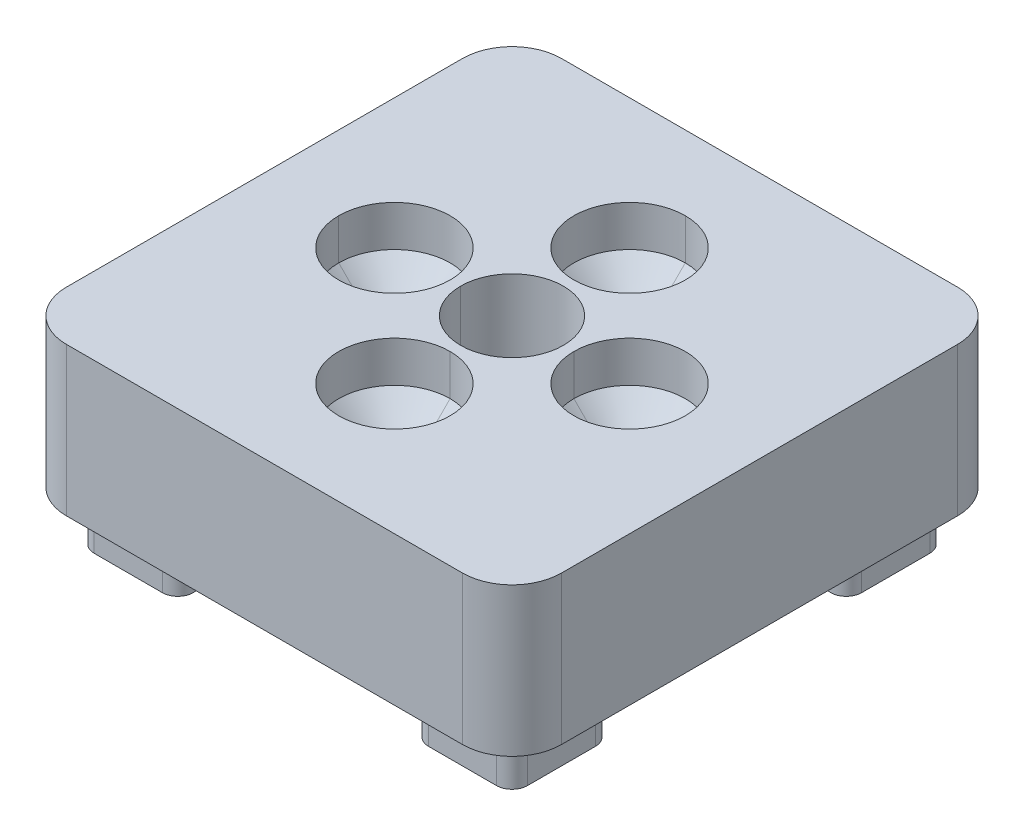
ISO-10303-21;
HEADER;
FILE_DESCRIPTION(('STEP AP214'),'2;1');
FILE_NAME('part.step','',(''),(''),'','','');
FILE_SCHEMA(('AUTOMOTIVE_DESIGN { 1 0 10303 214 1 1 1 1 }'));
ENDSEC;
DATA;
#1=APPLICATION_CONTEXT('core data for automotive mechanical design processes');
#2=APPLICATION_PROTOCOL_DEFINITION('international standard','automotive_design',2000,#1);
#3=PRODUCT_CONTEXT('',#1,'mechanical');
#4=PRODUCT('Part','Part','',(#3));
#5=PRODUCT_RELATED_PRODUCT_CATEGORY('part','',(#4));
#6=PRODUCT_DEFINITION_FORMATION('','',#4);
#7=PRODUCT_DEFINITION_CONTEXT('part definition',#1,'design');
#8=PRODUCT_DEFINITION('design','',#6,#7);
#9=PRODUCT_DEFINITION_SHAPE('','',#8);
#10=(LENGTH_UNIT() NAMED_UNIT(*) SI_UNIT(.MILLI.,.METRE.));
#11=(NAMED_UNIT(*) PLANE_ANGLE_UNIT() SI_UNIT($,.RADIAN.));
#12=(NAMED_UNIT(*) SI_UNIT($,.STERADIAN.) SOLID_ANGLE_UNIT());
#13=UNCERTAINTY_MEASURE_WITH_UNIT(LENGTH_MEASURE(1.E-05),#10,'distance_accuracy_value','');
#14=(GEOMETRIC_REPRESENTATION_CONTEXT(3) GLOBAL_UNCERTAINTY_ASSIGNED_CONTEXT((#13)) GLOBAL_UNIT_ASSIGNED_CONTEXT((#10,
#11,#12)) REPRESENTATION_CONTEXT('',''));
#15=CARTESIAN_POINT('',(0.,0.,0.));
#16=DIRECTION('',(0.,0.,1.));
#17=DIRECTION('',(1.,0.,0.));
#18=AXIS2_PLACEMENT_3D('',#15,#16,#17);
#19=CARTESIAN_POINT('',(20.,6.,0.));
#20=DIRECTION('',(-1.,0.,0.));
#21=DIRECTION('',(0.,0.,1.));
#22=AXIS2_PLACEMENT_3D('',#19,#20,#21);
#23=PLANE('',#22);
#24=DIRECTION('',(0.,1.,0.));
#25=VECTOR('',#24,1.);
#26=CARTESIAN_POINT('',(20.,6.,15.9999999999));
#27=LINE('',#26,#25);
#28=CARTESIAN_POINT('',(20.,0.,16.));
#29=VERTEX_POINT('',#28);
#30=CARTESIAN_POINT('',(20.,12.,16.));
#31=VERTEX_POINT('',#30);
#32=EDGE_CURVE('E573',#29,#31,#27,.T.);
#33=ORIENTED_EDGE('',*,*,#32,.F.);
#34=DIRECTION('',(0.,0.,-1.));
#35=VECTOR('',#34,1.);
#36=CARTESIAN_POINT('',(20.,0.,0.));
#37=LINE('',#36,#35);
#38=CARTESIAN_POINT('',(19.9999999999,0.,-15.9999999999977));
#39=VERTEX_POINT('',#38);
#40=EDGE_CURVE('E48',#29,#39,#37,.T.);
#41=ORIENTED_EDGE('',*,*,#40,.T.);
#42=DIRECTION('',(0.,1.,0.));
#43=VECTOR('',#42,1.);
#44=CARTESIAN_POINT('',(20.,6.,-15.9999999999));
#45=LINE('',#44,#43);
#46=CARTESIAN_POINT('',(19.9999999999,12.,-15.9999999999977));
#47=VERTEX_POINT('',#46);
#48=EDGE_CURVE('E584',#39,#47,#45,.T.);
#49=ORIENTED_EDGE('',*,*,#48,.T.);
#50=DIRECTION('',(0.,0.,-1.));
#51=VECTOR('',#50,1.);
#52=CARTESIAN_POINT('',(20.,12.,0.));
#53=LINE('',#52,#51);
#54=EDGE_CURVE('E57',#31,#47,#53,.T.);
#55=ORIENTED_EDGE('',*,*,#54,.F.);
#56=EDGE_LOOP('',(#33,#41,#49,#55));
#57=FACE_BOUND('',#56,.T.);
#58=ADVANCED_FACE('F38',(#57),#23,.F.);
#59=CARTESIAN_POINT('',(-20.,6.,0.));
#60=DIRECTION('',(1.,0.,0.));
#61=DIRECTION('',(0.,1.,0.));
#62=AXIS2_PLACEMENT_3D('',#59,#60,#61);
#63=PLANE('',#62);
#64=DIRECTION('',(0.,1.,0.));
#65=VECTOR('',#64,1.);
#66=CARTESIAN_POINT('',(-20.,6.,-15.9999999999));
#67=LINE('',#66,#65);
#68=CARTESIAN_POINT('',(-20.,0.,-16.));
#69=VERTEX_POINT('',#68);
#70=CARTESIAN_POINT('',(-20.,12.,-16.));
#71=VERTEX_POINT('',#70);
#72=EDGE_CURVE('E673',#69,#71,#67,.T.);
#73=ORIENTED_EDGE('',*,*,#72,.F.);
#74=DIRECTION('',(0.,0.,-1.));
#75=VECTOR('',#74,1.);
#76=CARTESIAN_POINT('',(-20.,0.,0.));
#77=LINE('',#76,#75);
#78=CARTESIAN_POINT('',(-19.9999999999,0.,15.9999999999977));
#79=VERTEX_POINT('',#78);
#80=EDGE_CURVE('E11',#79,#69,#77,.T.);
#81=ORIENTED_EDGE('',*,*,#80,.F.);
#82=DIRECTION('',(0.,1.,0.));
#83=VECTOR('',#82,1.);
#84=CARTESIAN_POINT('',(-20.,6.,15.9999999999));
#85=LINE('',#84,#83);
#86=CARTESIAN_POINT('',(-19.9999999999,12.,15.9999999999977));
#87=VERTEX_POINT('',#86);
#88=EDGE_CURVE('E544',#79,#87,#85,.T.);
#89=ORIENTED_EDGE('',*,*,#88,.T.);
#90=DIRECTION('',(0.,0.,-1.));
#91=VECTOR('',#90,1.);
#92=CARTESIAN_POINT('',(-20.,12.,0.));
#93=LINE('',#92,#91);
#94=EDGE_CURVE('E581',#87,#71,#93,.T.);
#95=ORIENTED_EDGE('',*,*,#94,.T.);
#96=EDGE_LOOP('',(#73,#81,#89,#95));
#97=FACE_BOUND('',#96,.T.);
#98=ADVANCED_FACE('F996',(#97),#63,.F.);
#99=CARTESIAN_POINT('',(0.,0.,0.));
#100=DIRECTION('',(0.,1.,0.));
#101=DIRECTION('',(1.,0.,0.));
#102=AXIS2_PLACEMENT_3D('',#99,#100,#101);
#103=PLANE('',#102);
#104=DIRECTION('',(-1.,0.,0.));
#105=VECTOR('',#104,1.);
#106=CARTESIAN_POINT('',(0.,0.,-6.5));
#107=LINE('',#106,#105);
#108=CARTESIAN_POINT('',(6.5,0.,-6.5));
#109=VERTEX_POINT('',#108);
#110=CARTESIAN_POINT('',(-6.5,0.,-6.5));
#111=VERTEX_POINT('',#110);
#112=EDGE_CURVE('E611',#109,#111,#107,.T.);
#113=ORIENTED_EDGE('',*,*,#112,.T.);
#114=DIRECTION('',(0.,0.,1.));
#115=VECTOR('',#114,1.);
#116=CARTESIAN_POINT('',(-6.5,0.,0.));
#117=LINE('',#116,#115);
#118=CARTESIAN_POINT('',(-6.5,0.,6.5));
#119=VERTEX_POINT('',#118);
#120=EDGE_CURVE('E855',#111,#119,#117,.T.);
#121=ORIENTED_EDGE('',*,*,#120,.T.);
#122=DIRECTION('',(1.,0.,0.));
#123=VECTOR('',#122,1.);
#124=CARTESIAN_POINT('',(0.,0.,6.5));
#125=LINE('',#124,#123);
#126=CARTESIAN_POINT('',(6.5,0.,6.5));
#127=VERTEX_POINT('',#126);
#128=EDGE_CURVE('E764',#119,#127,#125,.T.);
#129=ORIENTED_EDGE('',*,*,#128,.T.);
#130=DIRECTION('',(0.,0.,-1.));
#131=VECTOR('',#130,1.);
#132=CARTESIAN_POINT('',(6.5,0.,0.));
#133=LINE('',#132,#131);
#134=EDGE_CURVE('E306',#127,#109,#133,.T.);
#135=ORIENTED_EDGE('',*,*,#134,.T.);
#136=EDGE_LOOP('',(#113,#121,#129,#135));
#137=FACE_BOUND('',#136,.T.);
#138=CARTESIAN_POINT('',(9.5,0.,0.));
#139=DIRECTION('',(0.,1.,0.));
#140=DIRECTION('',(1.,0.,0.));
#141=AXIS2_PLACEMENT_3D('',#138,#139,#140);
#142=CIRCLE('',#141,2.25);
#143=CARTESIAN_POINT('',(11.75,0.,0.));
#144=VERTEX_POINT('',#143);
#145=CARTESIAN_POINT('',(7.25,0.,0.));
#146=VERTEX_POINT('',#145);
#147=EDGE_CURVE('E606',#144,#146,#142,.T.);
#148=ORIENTED_EDGE('',*,*,#147,.T.);
#149=CARTESIAN_POINT('',(9.5,0.,0.));
#150=DIRECTION('',(0.,1.,0.));
#151=DIRECTION('',(1.,0.,0.));
#152=AXIS2_PLACEMENT_3D('',#149,#150,#151);
#153=CIRCLE('',#152,2.25);
#154=EDGE_CURVE('E484',#146,#144,#153,.T.);
#155=ORIENTED_EDGE('',*,*,#154,.T.);
#156=EDGE_LOOP('',(#148,#155));
#157=FACE_BOUND('',#156,.T.);
#158=CARTESIAN_POINT('',(0.,0.,-9.5));
#159=DIRECTION('',(0.,1.,0.));
#160=DIRECTION('',(0.,0.,-1.));
#161=AXIS2_PLACEMENT_3D('',#158,#159,#160);
#162=CIRCLE('',#161,2.25);
#163=CARTESIAN_POINT('',(0.,0.,-11.75));
#164=VERTEX_POINT('',#163);
#165=CARTESIAN_POINT('',(0.,0.,-7.25));
#166=VERTEX_POINT('',#165);
#167=EDGE_CURVE('E602',#164,#166,#162,.T.);
#168=ORIENTED_EDGE('',*,*,#167,.T.);
#169=CARTESIAN_POINT('',(0.,0.,-9.5));
#170=DIRECTION('',(0.,1.,0.));
#171=DIRECTION('',(0.,0.,-1.));
#172=AXIS2_PLACEMENT_3D('',#169,#170,#171);
#173=CIRCLE('',#172,2.25);
#174=EDGE_CURVE('E494',#166,#164,#173,.T.);
#175=ORIENTED_EDGE('',*,*,#174,.T.);
#176=EDGE_LOOP('',(#168,#175));
#177=FACE_BOUND('',#176,.T.);
#178=CARTESIAN_POINT('',(-9.5,0.,0.));
#179=DIRECTION('',(0.,1.,0.));
#180=DIRECTION('',(-1.,0.,0.));
#181=AXIS2_PLACEMENT_3D('',#178,#179,#180);
#182=CIRCLE('',#181,2.25);
#183=CARTESIAN_POINT('',(-11.75,0.,0.));
#184=VERTEX_POINT('',#183);
#185=CARTESIAN_POINT('',(-7.25,0.,0.));
#186=VERTEX_POINT('',#185);
#187=EDGE_CURVE('E589',#184,#186,#182,.T.);
#188=ORIENTED_EDGE('',*,*,#187,.T.);
#189=CARTESIAN_POINT('',(-9.5,0.,0.));
#190=DIRECTION('',(0.,1.,0.));
#191=DIRECTION('',(-1.,0.,0.));
#192=AXIS2_PLACEMENT_3D('',#189,#190,#191);
#193=CIRCLE('',#192,2.25);
#194=EDGE_CURVE('E661',#186,#184,#193,.T.);
#195=ORIENTED_EDGE('',*,*,#194,.T.);
#196=EDGE_LOOP('',(#188,#195));
#197=FACE_BOUND('',#196,.T.);
#198=CARTESIAN_POINT('',(0.,0.,9.5));
#199=DIRECTION('',(0.,1.,0.));
#200=DIRECTION('',(0.,0.,1.));
#201=AXIS2_PLACEMENT_3D('',#198,#199,#200);
#202=CIRCLE('',#201,2.25);
#203=CARTESIAN_POINT('',(0.,0.,11.75));
#204=VERTEX_POINT('',#203);
#205=CARTESIAN_POINT('',(0.,0.,7.25));
#206=VERTEX_POINT('',#205);
#207=EDGE_CURVE('E613',#204,#206,#202,.T.);
#208=ORIENTED_EDGE('',*,*,#207,.T.);
#209=CARTESIAN_POINT('',(0.,0.,9.5));
#210=DIRECTION('',(0.,1.,0.));
#211=DIRECTION('',(0.,0.,1.));
#212=AXIS2_PLACEMENT_3D('',#209,#210,#211);
#213=CIRCLE('',#212,2.25);
#214=EDGE_CURVE('E549',#206,#204,#213,.T.);
#215=ORIENTED_EDGE('',*,*,#214,.T.);
#216=EDGE_LOOP('',(#208,#215));
#217=FACE_BOUND('',#216,.T.);
#218=DIRECTION('',(0.,0.,1.));
#219=VECTOR('',#218,1.);
#220=CARTESIAN_POINT('',(15.,0.,6.125));
#221=LINE('',#220,#219);
#222=CARTESIAN_POINT('',(15.,0.,10.75));
#223=VERTEX_POINT('',#222);
#224=CARTESIAN_POINT('',(15.,0.,13.75));
#225=VERTEX_POINT('',#224);
#226=EDGE_CURVE('E563',#223,#225,#221,.T.);
#227=ORIENTED_EDGE('',*,*,#226,.T.);
#228=CARTESIAN_POINT('',(13.75,0.,13.75));
#229=DIRECTION('',(0.,-1.,0.));
#230=DIRECTION('',(1.,0.,0.));
#231=AXIS2_PLACEMENT_3D('',#228,#229,#230);
#232=CIRCLE('',#231,1.25);
#233=CARTESIAN_POINT('',(13.75,0.,15.));
#234=VERTEX_POINT('',#233);
#235=EDGE_CURVE('E531',#225,#234,#232,.T.);
#236=ORIENTED_EDGE('',*,*,#235,.T.);
#237=DIRECTION('',(-1.,0.,0.));
#238=VECTOR('',#237,1.);
#239=CARTESIAN_POINT('',(6.125,0.,15.));
#240=LINE('',#239,#238);
#241=CARTESIAN_POINT('',(10.75,0.,15.));
#242=VERTEX_POINT('',#241);
#243=EDGE_CURVE('E699',#234,#242,#240,.T.);
#244=ORIENTED_EDGE('',*,*,#243,.T.);
#245=CARTESIAN_POINT('',(10.75,0.,16.25));
#246=DIRECTION('',(0.,1.,0.));
#247=DIRECTION('',(0.,0.,1.));
#248=AXIS2_PLACEMENT_3D('',#245,#246,#247);
#249=CIRCLE('',#248,1.25);
#250=CARTESIAN_POINT('',(10.75,0.,17.5));
#251=VERTEX_POINT('',#250);
#252=EDGE_CURVE('E621',#242,#251,#249,.T.);
#253=ORIENTED_EDGE('',*,*,#252,.T.);
#254=DIRECTION('',(1.,0.,0.));
#255=VECTOR('',#254,1.);
#256=CARTESIAN_POINT('',(6.75,0.,17.5));
#257=LINE('',#256,#255);
#258=CARTESIAN_POINT('',(16.25,0.,17.5));
#259=VERTEX_POINT('',#258);
#260=EDGE_CURVE('E839',#251,#259,#257,.T.);
#261=ORIENTED_EDGE('',*,*,#260,.T.);
#262=CARTESIAN_POINT('',(16.25,0.,16.25));
#263=DIRECTION('',(0.,1.,0.));
#264=DIRECTION('',(1.,0.,0.));
#265=AXIS2_PLACEMENT_3D('',#262,#263,#264);
#266=CIRCLE('',#265,1.25);
#267=CARTESIAN_POINT('',(17.5,0.,16.25));
#268=VERTEX_POINT('',#267);
#269=EDGE_CURVE('E536',#259,#268,#266,.T.);
#270=ORIENTED_EDGE('',*,*,#269,.T.);
#271=DIRECTION('',(0.,0.,-1.));
#272=VECTOR('',#271,1.);
#273=CARTESIAN_POINT('',(17.5,0.,6.75));
#274=LINE('',#273,#272);
#275=CARTESIAN_POINT('',(17.5,0.,10.75));
#276=VERTEX_POINT('',#275);
#277=EDGE_CURVE('E803',#268,#276,#274,.T.);
#278=ORIENTED_EDGE('',*,*,#277,.T.);
#279=CARTESIAN_POINT('',(16.25,0.,10.75));
#280=DIRECTION('',(0.,1.,0.));
#281=DIRECTION('',(-1.,0.,0.));
#282=AXIS2_PLACEMENT_3D('',#279,#280,#281);
#283=CIRCLE('',#282,1.25);
#284=EDGE_CURVE('E537',#276,#223,#283,.T.);
#285=ORIENTED_EDGE('',*,*,#284,.T.);
#286=EDGE_LOOP('',(#227,#236,#244,#253,#261,#270,#278,#285));
#287=FACE_BOUND('',#286,.T.);
#288=DIRECTION('',(-1.,0.,0.));
#289=VECTOR('',#288,1.);
#290=CARTESIAN_POINT('',(-6.125,0.,15.));
#291=LINE('',#290,#289);
#292=CARTESIAN_POINT('',(-10.75,0.,15.));
#293=VERTEX_POINT('',#292);
#294=CARTESIAN_POINT('',(-13.75,0.,15.));
#295=VERTEX_POINT('',#294);
#296=EDGE_CURVE('E638',#293,#295,#291,.T.);
#297=ORIENTED_EDGE('',*,*,#296,.T.);
#298=CARTESIAN_POINT('',(-13.75,0.,13.75));
#299=DIRECTION('',(0.,-1.,0.));
#300=DIRECTION('',(0.,0.,1.));
#301=AXIS2_PLACEMENT_3D('',#298,#299,#300);
#302=CIRCLE('',#301,1.25);
#303=CARTESIAN_POINT('',(-15.,0.,13.75));
#304=VERTEX_POINT('',#303);
#305=EDGE_CURVE('E737',#295,#304,#302,.T.);
#306=ORIENTED_EDGE('',*,*,#305,.T.);
#307=DIRECTION('',(0.,0.,-1.));
#308=VECTOR('',#307,1.);
#309=CARTESIAN_POINT('',(-15.,0.,6.125));
#310=LINE('',#309,#308);
#311=CARTESIAN_POINT('',(-15.,0.,10.75));
#312=VERTEX_POINT('',#311);
#313=EDGE_CURVE('E630',#304,#312,#310,.T.);
#314=ORIENTED_EDGE('',*,*,#313,.T.);
#315=CARTESIAN_POINT('',(-16.25,0.,10.75));
#316=DIRECTION('',(0.,1.,0.));
#317=DIRECTION('',(-1.,0.,0.));
#318=AXIS2_PLACEMENT_3D('',#315,#316,#317);
#319=CIRCLE('',#318,1.25);
#320=CARTESIAN_POINT('',(-17.5,0.,10.75));
#321=VERTEX_POINT('',#320);
#322=EDGE_CURVE('E509',#312,#321,#319,.T.);
#323=ORIENTED_EDGE('',*,*,#322,.T.);
#324=DIRECTION('',(0.,0.,1.));
#325=VECTOR('',#324,1.);
#326=CARTESIAN_POINT('',(-17.5,0.,6.75));
#327=LINE('',#326,#325);
#328=CARTESIAN_POINT('',(-17.5,0.,16.25));
#329=VERTEX_POINT('',#328);
#330=EDGE_CURVE('E586',#321,#329,#327,.T.);
#331=ORIENTED_EDGE('',*,*,#330,.T.);
#332=CARTESIAN_POINT('',(-16.25,0.,16.25));
#333=DIRECTION('',(0.,1.,0.));
#334=DIRECTION('',(0.,0.,1.));
#335=AXIS2_PLACEMENT_3D('',#332,#333,#334);
#336=CIRCLE('',#335,1.25);
#337=CARTESIAN_POINT('',(-16.25,0.,17.5));
#338=VERTEX_POINT('',#337);
#339=EDGE_CURVE('E214',#329,#338,#336,.T.);
#340=ORIENTED_EDGE('',*,*,#339,.T.);
#341=DIRECTION('',(1.,0.,0.));
#342=VECTOR('',#341,1.);
#343=CARTESIAN_POINT('',(-6.75,0.,17.5));
#344=LINE('',#343,#342);
#345=CARTESIAN_POINT('',(-10.75,0.,17.5));
#346=VERTEX_POINT('',#345);
#347=EDGE_CURVE('E795',#338,#346,#344,.T.);
#348=ORIENTED_EDGE('',*,*,#347,.T.);
#349=CARTESIAN_POINT('',(-10.75,0.,16.25));
#350=DIRECTION('',(0.,1.,0.));
#351=DIRECTION('',(0.,0.,-1.));
#352=AXIS2_PLACEMENT_3D('',#349,#350,#351);
#353=CIRCLE('',#352,1.25);
#354=EDGE_CURVE('E862',#346,#293,#353,.T.);
#355=ORIENTED_EDGE('',*,*,#354,.T.);
#356=EDGE_LOOP('',(#297,#306,#314,#323,#331,#340,#348,#355));
#357=FACE_BOUND('',#356,.T.);
#358=DIRECTION('',(0.,0.,-1.));
#359=VECTOR('',#358,1.);
#360=CARTESIAN_POINT('',(-15.,0.,-6.125));
#361=LINE('',#360,#359);
#362=CARTESIAN_POINT('',(-15.,0.,-10.75));
#363=VERTEX_POINT('',#362);
#364=CARTESIAN_POINT('',(-15.,0.,-13.75));
#365=VERTEX_POINT('',#364);
#366=EDGE_CURVE('E469',#363,#365,#361,.T.);
#367=ORIENTED_EDGE('',*,*,#366,.T.);
#368=CARTESIAN_POINT('',(-13.75,0.,-13.75));
#369=DIRECTION('',(0.,-1.,0.));
#370=DIRECTION('',(-1.,0.,0.));
#371=AXIS2_PLACEMENT_3D('',#368,#369,#370);
#372=CIRCLE('',#371,1.25);
#373=CARTESIAN_POINT('',(-13.75,0.,-15.));
#374=VERTEX_POINT('',#373);
#375=EDGE_CURVE('E453',#365,#374,#372,.T.);
#376=ORIENTED_EDGE('',*,*,#375,.T.);
#377=DIRECTION('',(1.,0.,0.));
#378=VECTOR('',#377,1.);
#379=CARTESIAN_POINT('',(-6.125,0.,-15.));
#380=LINE('',#379,#378);
#381=CARTESIAN_POINT('',(-10.75,0.,-15.));
#382=VERTEX_POINT('',#381);
#383=EDGE_CURVE('E459',#374,#382,#380,.T.);
#384=ORIENTED_EDGE('',*,*,#383,.T.);
#385=CARTESIAN_POINT('',(-10.75,0.,-16.25));
#386=DIRECTION('',(0.,1.,0.));
#387=DIRECTION('',(0.,0.,-1.));
#388=AXIS2_PLACEMENT_3D('',#385,#386,#387);
#389=CIRCLE('',#388,1.25);
#390=CARTESIAN_POINT('',(-10.75,0.,-17.5));
#391=VERTEX_POINT('',#390);
#392=EDGE_CURVE('E637',#382,#391,#389,.T.);
#393=ORIENTED_EDGE('',*,*,#392,.T.);
#394=DIRECTION('',(-1.,0.,0.));
#395=VECTOR('',#394,1.);
#396=CARTESIAN_POINT('',(-6.75,0.,-17.5));
#397=LINE('',#396,#395);
#398=CARTESIAN_POINT('',(-16.25,0.,-17.5));
#399=VERTEX_POINT('',#398);
#400=EDGE_CURVE('E554',#391,#399,#397,.T.);
#401=ORIENTED_EDGE('',*,*,#400,.T.);
#402=CARTESIAN_POINT('',(-16.25,0.,-16.25));
#403=DIRECTION('',(0.,1.,0.));
#404=DIRECTION('',(-1.,0.,0.));
#405=AXIS2_PLACEMENT_3D('',#402,#403,#404);
#406=CIRCLE('',#405,1.25);
#407=CARTESIAN_POINT('',(-17.5,0.,-16.25));
#408=VERTEX_POINT('',#407);
#409=EDGE_CURVE('E755',#399,#408,#406,.T.);
#410=ORIENTED_EDGE('',*,*,#409,.T.);
#411=DIRECTION('',(0.,0.,1.));
#412=VECTOR('',#411,1.);
#413=CARTESIAN_POINT('',(-17.5,0.,-6.75));
#414=LINE('',#413,#412);
#415=CARTESIAN_POINT('',(-17.5,0.,-10.75));
#416=VERTEX_POINT('',#415);
#417=EDGE_CURVE('E901',#408,#416,#414,.T.);
#418=ORIENTED_EDGE('',*,*,#417,.T.);
#419=CARTESIAN_POINT('',(-16.25,0.,-10.75));
#420=DIRECTION('',(0.,1.,0.));
#421=DIRECTION('',(1.,0.,0.));
#422=AXIS2_PLACEMENT_3D('',#419,#420,#421);
#423=CIRCLE('',#422,1.25);
#424=EDGE_CURVE('E691',#416,#363,#423,.T.);
#425=ORIENTED_EDGE('',*,*,#424,.T.);
#426=EDGE_LOOP('',(#367,#376,#384,#393,#401,#410,#418,#425));
#427=FACE_BOUND('',#426,.T.);
#428=DIRECTION('',(1.,0.,0.));
#429=VECTOR('',#428,1.);
#430=CARTESIAN_POINT('',(6.125,0.,-15.));
#431=LINE('',#430,#429);
#432=CARTESIAN_POINT('',(10.75,0.,-15.));
#433=VERTEX_POINT('',#432);
#434=CARTESIAN_POINT('',(13.75,0.,-15.));
#435=VERTEX_POINT('',#434);
#436=EDGE_CURVE('E622',#433,#435,#431,.T.);
#437=ORIENTED_EDGE('',*,*,#436,.T.);
#438=CARTESIAN_POINT('',(13.75,0.,-13.75));
#439=DIRECTION('',(0.,-1.,0.));
#440=DIRECTION('',(0.,0.,-1.));
#441=AXIS2_PLACEMENT_3D('',#438,#439,#440);
#442=CIRCLE('',#441,1.25);
#443=CARTESIAN_POINT('',(15.,0.,-13.75));
#444=VERTEX_POINT('',#443);
#445=EDGE_CURVE('E572',#435,#444,#442,.T.);
#446=ORIENTED_EDGE('',*,*,#445,.T.);
#447=DIRECTION('',(0.,0.,1.));
#448=VECTOR('',#447,1.);
#449=CARTESIAN_POINT('',(15.,0.,-6.125));
#450=LINE('',#449,#448);
#451=CARTESIAN_POINT('',(15.,0.,-10.75));
#452=VERTEX_POINT('',#451);
#453=EDGE_CURVE('E727',#444,#452,#450,.T.);
#454=ORIENTED_EDGE('',*,*,#453,.T.);
#455=CARTESIAN_POINT('',(16.25,0.,-10.75));
#456=DIRECTION('',(0.,1.,0.));
#457=DIRECTION('',(1.,0.,0.));
#458=AXIS2_PLACEMENT_3D('',#455,#456,#457);
#459=CIRCLE('',#458,1.25);
#460=CARTESIAN_POINT('',(17.5,0.,-10.75));
#461=VERTEX_POINT('',#460);
#462=EDGE_CURVE('E489',#452,#461,#459,.T.);
#463=ORIENTED_EDGE('',*,*,#462,.T.);
#464=DIRECTION('',(0.,0.,-1.));
#465=VECTOR('',#464,1.);
#466=CARTESIAN_POINT('',(17.5,0.,-6.75));
#467=LINE('',#466,#465);
#468=CARTESIAN_POINT('',(17.5,0.,-16.25));
#469=VERTEX_POINT('',#468);
#470=EDGE_CURVE('E759',#461,#469,#467,.T.);
#471=ORIENTED_EDGE('',*,*,#470,.T.);
#472=CARTESIAN_POINT('',(16.25,0.,-16.25));
#473=DIRECTION('',(0.,1.,0.));
#474=DIRECTION('',(0.,0.,-1.));
#475=AXIS2_PLACEMENT_3D('',#472,#473,#474);
#476=CIRCLE('',#475,1.25);
#477=CARTESIAN_POINT('',(16.25,0.,-17.5));
#478=VERTEX_POINT('',#477);
#479=EDGE_CURVE('E774',#469,#478,#476,.T.);
#480=ORIENTED_EDGE('',*,*,#479,.T.);
#481=DIRECTION('',(-1.,0.,0.));
#482=VECTOR('',#481,1.);
#483=CARTESIAN_POINT('',(6.75,0.,-17.5));
#484=LINE('',#483,#482);
#485=CARTESIAN_POINT('',(10.75,0.,-17.5));
#486=VERTEX_POINT('',#485);
#487=EDGE_CURVE('E499',#478,#486,#484,.T.);
#488=ORIENTED_EDGE('',*,*,#487,.T.);
#489=CARTESIAN_POINT('',(10.75,0.,-16.25));
#490=DIRECTION('',(0.,1.,0.));
#491=DIRECTION('',(0.,0.,1.));
#492=AXIS2_PLACEMENT_3D('',#489,#490,#491);
#493=CIRCLE('',#492,1.25);
#494=EDGE_CURVE('E688',#486,#433,#493,.T.);
#495=ORIENTED_EDGE('',*,*,#494,.T.);
#496=EDGE_LOOP('',(#437,#446,#454,#463,#471,#480,#488,#495));
#497=FACE_BOUND('',#496,.T.);
#498=CARTESIAN_POINT('',(-15.9999999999,0.,-15.9999999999));
#499=DIRECTION('',(0.,-1.,0.));
#500=DIRECTION('',(-1.,0.,-2.44313458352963E-11));
#501=AXIS2_PLACEMENT_3D('',#498,#499,#500);
#502=CIRCLE('',#501,4.);
#503=CARTESIAN_POINT('',(-15.9999999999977,0.,-19.9999999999));
#504=VERTEX_POINT('',#503);
#505=EDGE_CURVE('E670',#69,#504,#502,.T.);
#506=ORIENTED_EDGE('',*,*,#505,.T.);
#507=DIRECTION('',(-1.,0.,0.));
#508=VECTOR('',#507,1.);
#509=CARTESIAN_POINT('',(0.,0.,-20.));
#510=LINE('',#509,#508);
#511=CARTESIAN_POINT('',(15.9999999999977,0.,-19.9999999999));
#512=VERTEX_POINT('',#511);
#513=EDGE_CURVE('E712',#512,#504,#510,.T.);
#514=ORIENTED_EDGE('',*,*,#513,.F.);
#515=CARTESIAN_POINT('',(15.9999999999,0.,-15.9999999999));
#516=DIRECTION('',(0.,-1.,0.));
#517=DIRECTION('',(2.443512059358E-11,0.,-1.));
#518=AXIS2_PLACEMENT_3D('',#515,#516,#517);
#519=CIRCLE('',#518,4.);
#520=EDGE_CURVE('E646',#512,#39,#519,.T.);
#521=ORIENTED_EDGE('',*,*,#520,.T.);
#522=ORIENTED_EDGE('',*,*,#40,.F.);
#523=CARTESIAN_POINT('',(15.9999999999,0.,15.9999999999));
#524=DIRECTION('',(0.,-1.,0.));
#525=DIRECTION('',(1.,0.,2.44302356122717E-11));
#526=AXIS2_PLACEMENT_3D('',#523,#524,#525);
#527=CIRCLE('',#526,4.);
#528=CARTESIAN_POINT('',(15.9999999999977,0.,19.9999999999));
#529=VERTEX_POINT('',#528);
#530=EDGE_CURVE('E577',#29,#529,#527,.T.);
#531=ORIENTED_EDGE('',*,*,#530,.T.);
#532=DIRECTION('',(1.,0.,0.));
#533=VECTOR('',#532,1.);
#534=CARTESIAN_POINT('',(0.,0.,20.));
#535=LINE('',#534,#533);
#536=CARTESIAN_POINT('',(-16.,0.,20.));
#537=VERTEX_POINT('',#536);
#538=EDGE_CURVE('E676',#537,#529,#535,.T.);
#539=ORIENTED_EDGE('',*,*,#538,.F.);
#540=CARTESIAN_POINT('',(-15.9999999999,0.,15.9999999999));
#541=DIRECTION('',(0.,-1.,0.));
#542=DIRECTION('',(-2.44364528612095E-11,0.,1.));
#543=AXIS2_PLACEMENT_3D('',#540,#541,#542);
#544=CIRCLE('',#543,4.);
#545=EDGE_CURVE('E633',#537,#79,#544,.T.);
#546=ORIENTED_EDGE('',*,*,#545,.T.);
#547=ORIENTED_EDGE('',*,*,#80,.T.);
#548=EDGE_LOOP('',(#506,#514,#521,#522,#531,#539,#546,#547));
#549=FACE_BOUND('',#548,.T.);
#550=ADVANCED_FACE('F974',(#137,#157,#177,#197,#217,#287,#357,#427,#497,#549),#103,.F.);
#551=CARTESIAN_POINT('',(0.,6.,-20.));
#552=DIRECTION('',(0.,0.,1.));
#553=DIRECTION('',(1.,0.,0.));
#554=AXIS2_PLACEMENT_3D('',#551,#552,#553);
#555=PLANE('',#554);
#556=DIRECTION('',(0.,1.,0.));
#557=VECTOR('',#556,1.);
#558=CARTESIAN_POINT('',(-15.9999999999,6.,-20.));
#559=LINE('',#558,#557);
#560=CARTESIAN_POINT('',(-15.9999999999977,12.,-19.9999999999));
#561=VERTEX_POINT('',#560);
#562=EDGE_CURVE('E643',#504,#561,#559,.T.);
#563=ORIENTED_EDGE('',*,*,#562,.T.);
#564=DIRECTION('',(1.,0.,0.));
#565=VECTOR('',#564,1.);
#566=CARTESIAN_POINT('',(0.,12.,-20.));
#567=LINE('',#566,#565);
#568=CARTESIAN_POINT('',(15.9999999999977,12.,-19.9999999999));
#569=VERTEX_POINT('',#568);
#570=EDGE_CURVE('E674',#561,#569,#567,.T.);
#571=ORIENTED_EDGE('',*,*,#570,.T.);
#572=DIRECTION('',(0.,-1.,0.));
#573=VECTOR('',#572,1.);
#574=CARTESIAN_POINT('',(15.9999999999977,9.,-19.9999999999));
#575=LINE('',#574,#573);
#576=EDGE_CURVE('E685',#569,#512,#575,.T.);
#577=ORIENTED_EDGE('',*,*,#576,.T.);
#578=ORIENTED_EDGE('',*,*,#513,.T.);
#579=EDGE_LOOP('',(#563,#571,#577,#578));
#580=FACE_BOUND('',#579,.T.);
#581=ADVANCED_FACE('F991',(#580),#555,.F.);
#582=CARTESIAN_POINT('',(0.,6.,20.));
#583=DIRECTION('',(0.,0.,1.));
#584=DIRECTION('',(1.,0.,0.));
#585=AXIS2_PLACEMENT_3D('',#582,#583,#584);
#586=PLANE('',#585);
#587=DIRECTION('',(0.,1.,0.));
#588=VECTOR('',#587,1.);
#589=CARTESIAN_POINT('',(-15.9999999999,6.,20.));
#590=LINE('',#589,#588);
#591=CARTESIAN_POINT('',(-16.,12.,20.));
#592=VERTEX_POINT('',#591);
#593=EDGE_CURVE('E545',#537,#592,#590,.T.);
#594=ORIENTED_EDGE('',*,*,#593,.F.);
#595=ORIENTED_EDGE('',*,*,#538,.T.);
#596=DIRECTION('',(0.,1.,0.));
#597=VECTOR('',#596,1.);
#598=CARTESIAN_POINT('',(15.9999999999,6.,20.));
#599=LINE('',#598,#597);
#600=CARTESIAN_POINT('',(15.9999999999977,12.,19.9999999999));
#601=VERTEX_POINT('',#600);
#602=EDGE_CURVE('E682',#529,#601,#599,.T.);
#603=ORIENTED_EDGE('',*,*,#602,.T.);
#604=DIRECTION('',(-1.,0.,0.));
#605=VECTOR('',#604,1.);
#606=CARTESIAN_POINT('',(0.,12.,20.));
#607=LINE('',#606,#605);
#608=EDGE_CURVE('E583',#601,#592,#607,.T.);
#609=ORIENTED_EDGE('',*,*,#608,.T.);
#610=EDGE_LOOP('',(#594,#595,#603,#609));
#611=FACE_BOUND('',#610,.T.);
#612=ADVANCED_FACE('F964',(#611),#586,.T.);
#613=CARTESIAN_POINT('',(0.,12.,0.));
#614=DIRECTION('',(0.,-1.,0.));
#615=DIRECTION('',(0.,0.,-1.));
#616=AXIS2_PLACEMENT_3D('',#613,#614,#615);
#617=PLANE('',#616);
#618=CARTESIAN_POINT('',(0.,12.,0.));
#619=DIRECTION('',(0.,-1.,0.));
#620=DIRECTION('',(1.,0.,0.));
#621=AXIS2_PLACEMENT_3D('',#618,#619,#620);
#622=CIRCLE('',#621,4.15);
#623=CARTESIAN_POINT('',(4.15,12.,0.));
#624=VERTEX_POINT('',#623);
#625=CARTESIAN_POINT('',(-4.15,12.,0.));
#626=VERTEX_POINT('',#625);
#627=EDGE_CURVE('E713',#624,#626,#622,.T.);
#628=ORIENTED_EDGE('',*,*,#627,.T.);
#629=CARTESIAN_POINT('',(0.,12.,0.));
#630=DIRECTION('',(0.,-1.,0.));
#631=DIRECTION('',(1.,0.,0.));
#632=AXIS2_PLACEMENT_3D('',#629,#630,#631);
#633=CIRCLE('',#632,4.15);
#634=EDGE_CURVE('E731',#626,#624,#633,.T.);
#635=ORIENTED_EDGE('',*,*,#634,.T.);
#636=EDGE_LOOP('',(#628,#635));
#637=FACE_BOUND('',#636,.T.);
#638=CARTESIAN_POINT('',(9.5,12.,0.));
#639=DIRECTION('',(0.,-1.,0.));
#640=DIRECTION('',(1.,0.,0.));
#641=AXIS2_PLACEMENT_3D('',#638,#639,#640);
#642=CIRCLE('',#641,4.5);
#643=CARTESIAN_POINT('',(14.,12.,0.));
#644=VERTEX_POINT('',#643);
#645=CARTESIAN_POINT('',(5.,12.,0.));
#646=VERTEX_POINT('',#645);
#647=EDGE_CURVE('E668',#644,#646,#642,.T.);
#648=ORIENTED_EDGE('',*,*,#647,.T.);
#649=CARTESIAN_POINT('',(9.5,12.,0.));
#650=DIRECTION('',(0.,-1.,0.));
#651=DIRECTION('',(1.,0.,0.));
#652=AXIS2_PLACEMENT_3D('',#649,#650,#651);
#653=CIRCLE('',#652,4.5);
#654=EDGE_CURVE('E756',#646,#644,#653,.T.);
#655=ORIENTED_EDGE('',*,*,#654,.T.);
#656=EDGE_LOOP('',(#648,#655));
#657=FACE_BOUND('',#656,.T.);
#658=CARTESIAN_POINT('',(0.,12.,-9.5));
#659=DIRECTION('',(0.,-1.,0.));
#660=DIRECTION('',(0.,0.,-1.));
#661=AXIS2_PLACEMENT_3D('',#658,#659,#660);
#662=CIRCLE('',#661,4.5);
#663=CARTESIAN_POINT('',(0.,12.,-14.));
#664=VERTEX_POINT('',#663);
#665=CARTESIAN_POINT('',(0.,12.,-5.));
#666=VERTEX_POINT('',#665);
#667=EDGE_CURVE('E594',#664,#666,#662,.T.);
#668=ORIENTED_EDGE('',*,*,#667,.T.);
#669=CARTESIAN_POINT('',(0.,12.,-9.5));
#670=DIRECTION('',(0.,-1.,0.));
#671=DIRECTION('',(0.,0.,-1.));
#672=AXIS2_PLACEMENT_3D('',#669,#670,#671);
#673=CIRCLE('',#672,4.5);
#674=EDGE_CURVE('E856',#666,#664,#673,.T.);
#675=ORIENTED_EDGE('',*,*,#674,.T.);
#676=EDGE_LOOP('',(#668,#675));
#677=FACE_BOUND('',#676,.T.);
#678=CARTESIAN_POINT('',(-9.5,12.,0.));
#679=DIRECTION('',(0.,-1.,0.));
#680=DIRECTION('',(-1.,0.,0.));
#681=AXIS2_PLACEMENT_3D('',#678,#679,#680);
#682=CIRCLE('',#681,4.5);
#683=CARTESIAN_POINT('',(-14.,12.,0.));
#684=VERTEX_POINT('',#683);
#685=CARTESIAN_POINT('',(-5.,12.,0.));
#686=VERTEX_POINT('',#685);
#687=EDGE_CURVE('E550',#684,#686,#682,.T.);
#688=ORIENTED_EDGE('',*,*,#687,.T.);
#689=CARTESIAN_POINT('',(-9.5,12.,0.));
#690=DIRECTION('',(0.,-1.,0.));
#691=DIRECTION('',(-1.,0.,0.));
#692=AXIS2_PLACEMENT_3D('',#689,#690,#691);
#693=CIRCLE('',#692,4.5);
#694=EDGE_CURVE('E615',#686,#684,#693,.T.);
#695=ORIENTED_EDGE('',*,*,#694,.T.);
#696=EDGE_LOOP('',(#688,#695));
#697=FACE_BOUND('',#696,.T.);
#698=CARTESIAN_POINT('',(0.,12.,9.5));
#699=DIRECTION('',(0.,-1.,0.));
#700=DIRECTION('',(0.,0.,1.));
#701=AXIS2_PLACEMENT_3D('',#698,#699,#700);
#702=CIRCLE('',#701,4.5);
#703=CARTESIAN_POINT('',(0.,12.,14.));
#704=VERTEX_POINT('',#703);
#705=CARTESIAN_POINT('',(0.,12.,5.));
#706=VERTEX_POINT('',#705);
#707=EDGE_CURVE('E741',#704,#706,#702,.T.);
#708=ORIENTED_EDGE('',*,*,#707,.T.);
#709=CARTESIAN_POINT('',(0.,12.,9.5));
#710=DIRECTION('',(0.,-1.,0.));
#711=DIRECTION('',(0.,0.,1.));
#712=AXIS2_PLACEMENT_3D('',#709,#710,#711);
#713=CIRCLE('',#712,4.5);
#714=EDGE_CURVE('E539',#706,#704,#713,.T.);
#715=ORIENTED_EDGE('',*,*,#714,.T.);
#716=EDGE_LOOP('',(#708,#715));
#717=FACE_BOUND('',#716,.T.);
#718=CARTESIAN_POINT('',(-15.9999999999,12.,-15.9999999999));
#719=DIRECTION('',(0.,1.,0.));
#720=DIRECTION('',(-1.,0.,-2.44313458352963E-11));
#721=AXIS2_PLACEMENT_3D('',#718,#719,#720);
#722=CIRCLE('',#721,4.);
#723=EDGE_CURVE('E647',#561,#71,#722,.T.);
#724=ORIENTED_EDGE('',*,*,#723,.T.);
#725=ORIENTED_EDGE('',*,*,#94,.F.);
#726=CARTESIAN_POINT('',(-15.9999999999,12.,15.9999999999));
#727=DIRECTION('',(0.,1.,0.));
#728=DIRECTION('',(-2.44364528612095E-11,0.,1.));
#729=AXIS2_PLACEMENT_3D('',#726,#727,#728);
#730=CIRCLE('',#729,4.);
#731=EDGE_CURVE('E541',#87,#592,#730,.T.);
#732=ORIENTED_EDGE('',*,*,#731,.T.);
#733=ORIENTED_EDGE('',*,*,#608,.F.);
#734=CARTESIAN_POINT('',(15.9999999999,12.,15.9999999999));
#735=DIRECTION('',(0.,1.,0.));
#736=DIRECTION('',(1.,0.,2.44302356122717E-11));
#737=AXIS2_PLACEMENT_3D('',#734,#735,#736);
#738=CIRCLE('',#737,4.);
#739=EDGE_CURVE('E576',#601,#31,#738,.T.);
#740=ORIENTED_EDGE('',*,*,#739,.T.);
#741=ORIENTED_EDGE('',*,*,#54,.T.);
#742=CARTESIAN_POINT('',(15.9999999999,12.,-15.9999999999));
#743=DIRECTION('',(0.,1.,0.));
#744=DIRECTION('',(2.443512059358E-11,0.,-1.));
#745=AXIS2_PLACEMENT_3D('',#742,#743,#744);
#746=CIRCLE('',#745,4.);
#747=EDGE_CURVE('E934',#47,#569,#746,.T.);
#748=ORIENTED_EDGE('',*,*,#747,.T.);
#749=ORIENTED_EDGE('',*,*,#570,.F.);
#750=EDGE_LOOP('',(#724,#725,#732,#733,#740,#741,#748,#749));
#751=FACE_BOUND('',#750,.T.);
#752=ADVANCED_FACE('F969',(#637,#657,#677,#697,#717,#751),#617,.F.);
#753=CARTESIAN_POINT('',(15.9999999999,12.,-15.9999999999));
#754=DIRECTION('',(0.,-1.,0.));
#755=DIRECTION('',(2.443512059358E-11,0.,-1.));
#756=AXIS2_PLACEMENT_3D('',#753,#754,#755);
#757=CYLINDRICAL_SURFACE('',#756,4.);
#758=ORIENTED_EDGE('',*,*,#520,.F.);
#759=ORIENTED_EDGE('',*,*,#576,.F.);
#760=ORIENTED_EDGE('',*,*,#747,.F.);
#761=ORIENTED_EDGE('',*,*,#48,.F.);
#762=EDGE_LOOP('',(#758,#759,#760,#761));
#763=FACE_BOUND('',#762,.T.);
#764=ADVANCED_FACE('F986',(#763),#757,.T.);
#765=CARTESIAN_POINT('',(-15.9999999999,12.,-15.9999999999));
#766=DIRECTION('',(0.,-1.,0.));
#767=DIRECTION('',(-1.,0.,-2.44313458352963E-11));
#768=AXIS2_PLACEMENT_3D('',#765,#766,#767);
#769=CYLINDRICAL_SURFACE('',#768,4.);
#770=ORIENTED_EDGE('',*,*,#505,.F.);
#771=ORIENTED_EDGE('',*,*,#72,.T.);
#772=ORIENTED_EDGE('',*,*,#723,.F.);
#773=ORIENTED_EDGE('',*,*,#562,.F.);
#774=EDGE_LOOP('',(#770,#771,#772,#773));
#775=FACE_BOUND('',#774,.T.);
#776=ADVANCED_FACE('F994',(#775),#769,.T.);
#777=CARTESIAN_POINT('',(-15.9999999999,12.,15.9999999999));
#778=DIRECTION('',(0.,-1.,0.));
#779=DIRECTION('',(-2.44364528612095E-11,0.,1.));
#780=AXIS2_PLACEMENT_3D('',#777,#778,#779);
#781=CYLINDRICAL_SURFACE('',#780,4.);
#782=ORIENTED_EDGE('',*,*,#545,.F.);
#783=ORIENTED_EDGE('',*,*,#593,.T.);
#784=ORIENTED_EDGE('',*,*,#731,.F.);
#785=ORIENTED_EDGE('',*,*,#88,.F.);
#786=EDGE_LOOP('',(#782,#783,#784,#785));
#787=FACE_BOUND('',#786,.T.);
#788=ADVANCED_FACE('F972',(#787),#781,.T.);
#789=CARTESIAN_POINT('',(15.9999999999,12.,15.9999999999));
#790=DIRECTION('',(0.,-1.,0.));
#791=DIRECTION('',(1.,0.,2.44302356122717E-11));
#792=AXIS2_PLACEMENT_3D('',#789,#790,#791);
#793=CYLINDRICAL_SURFACE('',#792,4.);
#794=ORIENTED_EDGE('',*,*,#530,.F.);
#795=ORIENTED_EDGE('',*,*,#32,.T.);
#796=ORIENTED_EDGE('',*,*,#739,.F.);
#797=ORIENTED_EDGE('',*,*,#602,.F.);
#798=EDGE_LOOP('',(#794,#795,#796,#797));
#799=FACE_BOUND('',#798,.T.);
#800=ADVANCED_FACE('F978',(#799),#793,.T.);
#801=CARTESIAN_POINT('',(6.5,2.65,0.));
#802=DIRECTION('',(-1.,0.,0.));
#803=DIRECTION('',(0.,0.,1.));
#804=AXIS2_PLACEMENT_3D('',#801,#802,#803);
#805=PLANE('',#804);
#806=ORIENTED_EDGE('',*,*,#134,.F.);
#807=DIRECTION('',(0.,1.,0.));
#808=VECTOR('',#807,1.);
#809=CARTESIAN_POINT('',(6.5,2.65,6.5));
#810=LINE('',#809,#808);
#811=CARTESIAN_POINT('',(6.5,5.3,6.5));
#812=VERTEX_POINT('',#811);
#813=EDGE_CURVE('E715',#127,#812,#810,.T.);
#814=ORIENTED_EDGE('',*,*,#813,.T.);
#815=DIRECTION('',(0.,0.,-1.));
#816=VECTOR('',#815,1.);
#817=CARTESIAN_POINT('',(6.5,5.3,0.));
#818=LINE('',#817,#816);
#819=CARTESIAN_POINT('',(6.5,5.3,-6.5));
#820=VERTEX_POINT('',#819);
#821=EDGE_CURVE('E316',#812,#820,#818,.T.);
#822=ORIENTED_EDGE('',*,*,#821,.T.);
#823=DIRECTION('',(0.,-1.,0.));
#824=VECTOR('',#823,1.);
#825=CARTESIAN_POINT('',(6.5,2.65,-6.5));
#826=LINE('',#825,#824);
#827=EDGE_CURVE('E851',#820,#109,#826,.T.);
#828=ORIENTED_EDGE('',*,*,#827,.T.);
#829=EDGE_LOOP('',(#806,#814,#822,#828));
#830=FACE_BOUND('',#829,.T.);
#831=ADVANCED_FACE('F1011',(#830),#805,.T.);
#832=CARTESIAN_POINT('',(0.,5.3,0.));
#833=DIRECTION('',(0.,-1.,0.));
#834=DIRECTION('',(0.,0.,-1.));
#835=AXIS2_PLACEMENT_3D('',#832,#833,#834);
#836=PLANE('',#835);
#837=CARTESIAN_POINT('',(0.,5.3,0.));
#838=DIRECTION('',(0.,1.,0.));
#839=DIRECTION('',(1.,0.,0.));
#840=AXIS2_PLACEMENT_3D('',#837,#838,#839);
#841=CIRCLE('',#840,4.15);
#842=CARTESIAN_POINT('',(-4.15,5.3,0.));
#843=VERTEX_POINT('',#842);
#844=CARTESIAN_POINT('',(4.15,5.3,0.));
#845=VERTEX_POINT('',#844);
#846=EDGE_CURVE('E716',#843,#845,#841,.T.);
#847=ORIENTED_EDGE('',*,*,#846,.T.);
#848=CARTESIAN_POINT('',(0.,5.3,0.));
#849=DIRECTION('',(0.,1.,0.));
#850=DIRECTION('',(1.,0.,0.));
#851=AXIS2_PLACEMENT_3D('',#848,#849,#850);
#852=CIRCLE('',#851,4.15);
#853=EDGE_CURVE('E493',#845,#843,#852,.T.);
#854=ORIENTED_EDGE('',*,*,#853,.T.);
#855=EDGE_LOOP('',(#847,#854));
#856=FACE_BOUND('',#855,.T.);
#857=ORIENTED_EDGE('',*,*,#821,.F.);
#858=DIRECTION('',(-1.,0.,0.));
#859=VECTOR('',#858,1.);
#860=CARTESIAN_POINT('',(0.,5.3,6.5));
#861=LINE('',#860,#859);
#862=CARTESIAN_POINT('',(-6.5,5.3,6.5));
#863=VERTEX_POINT('',#862);
#864=EDGE_CURVE('E853',#812,#863,#861,.T.);
#865=ORIENTED_EDGE('',*,*,#864,.T.);
#866=DIRECTION('',(0.,0.,-1.));
#867=VECTOR('',#866,1.);
#868=CARTESIAN_POINT('',(-6.5,5.3,0.));
#869=LINE('',#868,#867);
#870=CARTESIAN_POINT('',(-6.5,5.3,-6.5));
#871=VERTEX_POINT('',#870);
#872=EDGE_CURVE('E890',#863,#871,#869,.T.);
#873=ORIENTED_EDGE('',*,*,#872,.T.);
#874=DIRECTION('',(1.,0.,0.));
#875=VECTOR('',#874,1.);
#876=CARTESIAN_POINT('',(0.,5.3,-6.5));
#877=LINE('',#876,#875);
#878=EDGE_CURVE('E612',#871,#820,#877,.T.);
#879=ORIENTED_EDGE('',*,*,#878,.T.);
#880=EDGE_LOOP('',(#857,#865,#873,#879));
#881=FACE_BOUND('',#880,.T.);
#882=ADVANCED_FACE('F1110',(#856,#881),#836,.T.);
#883=CARTESIAN_POINT('',(-6.5,2.65,0.));
#884=DIRECTION('',(1.,0.,0.));
#885=DIRECTION('',(0.,1.,0.));
#886=AXIS2_PLACEMENT_3D('',#883,#884,#885);
#887=PLANE('',#886);
#888=ORIENTED_EDGE('',*,*,#872,.F.);
#889=DIRECTION('',(0.,-1.,0.));
#890=VECTOR('',#889,1.);
#891=CARTESIAN_POINT('',(-6.5,2.65,6.5));
#892=LINE('',#891,#890);
#893=EDGE_CURVE('E766',#863,#119,#892,.T.);
#894=ORIENTED_EDGE('',*,*,#893,.T.);
#895=ORIENTED_EDGE('',*,*,#120,.F.);
#896=DIRECTION('',(0.,1.,0.));
#897=VECTOR('',#896,1.);
#898=CARTESIAN_POINT('',(-6.5,2.65,-6.5));
#899=LINE('',#898,#897);
#900=EDGE_CURVE('E608',#111,#871,#899,.T.);
#901=ORIENTED_EDGE('',*,*,#900,.T.);
#902=EDGE_LOOP('',(#888,#894,#895,#901));
#903=FACE_BOUND('',#902,.T.);
#904=ADVANCED_FACE('F1215',(#903),#887,.T.);
#905=CARTESIAN_POINT('',(0.,2.65,-6.5));
#906=DIRECTION('',(0.,0.,1.));
#907=DIRECTION('',(1.,0.,0.));
#908=AXIS2_PLACEMENT_3D('',#905,#906,#907);
#909=PLANE('',#908);
#910=ORIENTED_EDGE('',*,*,#827,.F.);
#911=ORIENTED_EDGE('',*,*,#878,.F.);
#912=ORIENTED_EDGE('',*,*,#900,.F.);
#913=ORIENTED_EDGE('',*,*,#112,.F.);
#914=EDGE_LOOP('',(#910,#911,#912,#913));
#915=FACE_BOUND('',#914,.T.);
#916=ADVANCED_FACE('F1217',(#915),#909,.T.);
#917=CARTESIAN_POINT('',(0.,2.65,6.5));
#918=DIRECTION('',(0.,0.,1.));
#919=DIRECTION('',(1.,0.,0.));
#920=AXIS2_PLACEMENT_3D('',#917,#918,#919);
#921=PLANE('',#920);
#922=ORIENTED_EDGE('',*,*,#813,.F.);
#923=ORIENTED_EDGE('',*,*,#128,.F.);
#924=ORIENTED_EDGE('',*,*,#893,.F.);
#925=ORIENTED_EDGE('',*,*,#864,.F.);
#926=EDGE_LOOP('',(#922,#923,#924,#925));
#927=FACE_BOUND('',#926,.T.);
#928=ADVANCED_FACE('F1131',(#927),#921,.F.);
#929=CARTESIAN_POINT('',(0.,6.,0.));
#930=DIRECTION('',(0.,1.,0.));
#931=DIRECTION('',(1.,0.,0.));
#932=AXIS2_PLACEMENT_3D('',#929,#930,#931);
#933=CYLINDRICAL_SURFACE('',#932,4.15);
#934=DIRECTION('',(0.,-1.,0.));
#935=VECTOR('',#934,1.);
#936=CARTESIAN_POINT('',(4.15,6.,0.));
#937=LINE('',#936,#935);
#938=EDGE_CURVE('E945',#624,#845,#937,.T.);
#939=ORIENTED_EDGE('',*,*,#938,.T.);
#940=ORIENTED_EDGE('',*,*,#846,.F.);
#941=DIRECTION('',(0.,1.,0.));
#942=VECTOR('',#941,1.);
#943=CARTESIAN_POINT('',(-4.15,6.,0.));
#944=LINE('',#943,#942);
#945=EDGE_CURVE('E728',#843,#626,#944,.T.);
#946=ORIENTED_EDGE('',*,*,#945,.T.);
#947=ORIENTED_EDGE('',*,*,#627,.F.);
#948=EDGE_LOOP('',(#939,#940,#946,#947));
#949=FACE_BOUND('',#948,.T.);
#950=ADVANCED_FACE('F1128',(#949),#933,.F.);
#951=CARTESIAN_POINT('',(9.5,3.225,0.));
#952=DIRECTION('',(0.,-1.,0.));
#953=DIRECTION('',(1.,0.,0.));
#954=AXIS2_PLACEMENT_3D('',#951,#952,#953);
#955=CYLINDRICAL_SURFACE('',#954,2.25);
#956=DIRECTION('',(0.,1.,0.));
#957=VECTOR('',#956,1.);
#958=CARTESIAN_POINT('',(11.75,3.225,0.));
#959=LINE('',#958,#957);
#960=CARTESIAN_POINT('',(11.75,6.45,0.));
#961=VERTEX_POINT('',#960);
#962=EDGE_CURVE('E490',#144,#961,#959,.T.);
#963=ORIENTED_EDGE('',*,*,#962,.T.);
#964=CARTESIAN_POINT('',(9.5,6.45,0.));
#965=DIRECTION('',(0.,-1.,0.));
#966=DIRECTION('',(1.,0.,0.));
#967=AXIS2_PLACEMENT_3D('',#964,#965,#966);
#968=CIRCLE('',#967,2.25);
#969=CARTESIAN_POINT('',(7.25,6.45,0.));
#970=VERTEX_POINT('',#969);
#971=EDGE_CURVE('E604',#970,#961,#968,.T.);
#972=ORIENTED_EDGE('',*,*,#971,.F.);
#973=DIRECTION('',(0.,-1.,0.));
#974=VECTOR('',#973,1.);
#975=CARTESIAN_POINT('',(7.25,3.225,0.));
#976=LINE('',#975,#974);
#977=EDGE_CURVE('E480',#970,#146,#976,.T.);
#978=ORIENTED_EDGE('',*,*,#977,.T.);
#979=ORIENTED_EDGE('',*,*,#147,.F.);
#980=EDGE_LOOP('',(#963,#972,#978,#979));
#981=FACE_BOUND('',#980,.T.);
#982=ADVANCED_FACE('F1126',(#981),#955,.F.);
#983=CARTESIAN_POINT('',(9.5,7.575,0.));
#984=DIRECTION('',(0.,1.,0.));
#985=DIRECTION('',(1.,0.,0.));
#986=AXIS2_PLACEMENT_3D('',#983,#984,#985);
#987=CONICAL_SURFACE('',#986,3.375,0.785398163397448);
#988=DIRECTION('',(0.707106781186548,0.707106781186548,0.));
#989=VECTOR('',#988,1.);
#990=CARTESIAN_POINT('',(12.875,7.575,0.));
#991=LINE('',#990,#989);
#992=CARTESIAN_POINT('',(14.,8.7,0.));
#993=VERTEX_POINT('',#992);
#994=EDGE_CURVE('E562',#961,#993,#991,.T.);
#995=ORIENTED_EDGE('',*,*,#994,.T.);
#996=CARTESIAN_POINT('',(9.5,8.7,0.));
#997=DIRECTION('',(0.,-1.,0.));
#998=DIRECTION('',(1.,0.,0.));
#999=AXIS2_PLACEMENT_3D('',#996,#997,#998);
#1000=CIRCLE('',#999,4.5);
#1001=CARTESIAN_POINT('',(5.,8.7,0.));
#1002=VERTEX_POINT('',#1001);
#1003=EDGE_CURVE('E607',#1002,#993,#1000,.T.);
#1004=ORIENTED_EDGE('',*,*,#1003,.F.);
#1005=DIRECTION('',(0.707106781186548,-0.707106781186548,0.));
#1006=VECTOR('',#1005,1.);
#1007=CARTESIAN_POINT('',(6.125,7.575,0.));
#1008=LINE('',#1007,#1006);
#1009=EDGE_CURVE('E593',#1002,#970,#1008,.T.);
#1010=ORIENTED_EDGE('',*,*,#1009,.T.);
#1011=ORIENTED_EDGE('',*,*,#971,.T.);
#1012=EDGE_LOOP('',(#995,#1004,#1010,#1011));
#1013=FACE_BOUND('',#1012,.T.);
#1014=ADVANCED_FACE('F1123',(#1013),#987,.F.);
#1015=CARTESIAN_POINT('',(9.5,10.35,0.));
#1016=DIRECTION('',(0.,-1.,0.));
#1017=DIRECTION('',(1.,0.,0.));
#1018=AXIS2_PLACEMENT_3D('',#1015,#1016,#1017);
#1019=CYLINDRICAL_SURFACE('',#1018,4.5);
#1020=DIRECTION('',(0.,1.,0.));
#1021=VECTOR('',#1020,1.);
#1022=CARTESIAN_POINT('',(14.,10.35,0.));
#1023=LINE('',#1022,#1021);
#1024=EDGE_CURVE('E504',#993,#644,#1023,.T.);
#1025=ORIENTED_EDGE('',*,*,#1024,.T.);
#1026=ORIENTED_EDGE('',*,*,#654,.F.);
#1027=DIRECTION('',(0.,-1.,0.));
#1028=VECTOR('',#1027,1.);
#1029=CARTESIAN_POINT('',(5.,10.35,0.));
#1030=LINE('',#1029,#1028);
#1031=EDGE_CURVE('E506',#646,#1002,#1030,.T.);
#1032=ORIENTED_EDGE('',*,*,#1031,.T.);
#1033=ORIENTED_EDGE('',*,*,#1003,.T.);
#1034=EDGE_LOOP('',(#1025,#1026,#1032,#1033));
#1035=FACE_BOUND('',#1034,.T.);
#1036=ADVANCED_FACE('F1118',(#1035),#1019,.F.);
#1037=CARTESIAN_POINT('',(0.,3.225,-9.5));
#1038=DIRECTION('',(0.,-1.,0.));
#1039=DIRECTION('',(0.,0.,-1.));
#1040=AXIS2_PLACEMENT_3D('',#1037,#1038,#1039);
#1041=CYLINDRICAL_SURFACE('',#1040,2.25);
#1042=DIRECTION('',(0.,1.,0.));
#1043=VECTOR('',#1042,1.);
#1044=CARTESIAN_POINT('',(0.,3.225,-11.75));
#1045=LINE('',#1044,#1043);
#1046=CARTESIAN_POINT('',(0.,6.45,-11.75));
#1047=VERTEX_POINT('',#1046);
#1048=EDGE_CURVE('E498',#164,#1047,#1045,.T.);
#1049=ORIENTED_EDGE('',*,*,#1048,.T.);
#1050=CARTESIAN_POINT('',(0.,6.45,-9.5));
#1051=DIRECTION('',(0.,-1.,0.));
#1052=DIRECTION('',(0.,0.,-1.));
#1053=AXIS2_PLACEMENT_3D('',#1050,#1051,#1052);
#1054=CIRCLE('',#1053,2.25);
#1055=CARTESIAN_POINT('',(0.,6.45,-7.25));
#1056=VERTEX_POINT('',#1055);
#1057=EDGE_CURVE('E600',#1056,#1047,#1054,.T.);
#1058=ORIENTED_EDGE('',*,*,#1057,.F.);
#1059=DIRECTION('',(0.,-1.,0.));
#1060=VECTOR('',#1059,1.);
#1061=CARTESIAN_POINT('',(0.,3.225,-7.25));
#1062=LINE('',#1061,#1060);
#1063=EDGE_CURVE('E497',#1056,#166,#1062,.T.);
#1064=ORIENTED_EDGE('',*,*,#1063,.T.);
#1065=ORIENTED_EDGE('',*,*,#167,.F.);
#1066=EDGE_LOOP('',(#1049,#1058,#1064,#1065));
#1067=FACE_BOUND('',#1066,.T.);
#1068=ADVANCED_FACE('F1114',(#1067),#1041,.F.);
#1069=CARTESIAN_POINT('',(0.,7.575,-9.5));
#1070=DIRECTION('',(0.,1.,0.));
#1071=DIRECTION('',(0.,0.,-1.));
#1072=AXIS2_PLACEMENT_3D('',#1069,#1070,#1071);
#1073=CONICAL_SURFACE('',#1072,3.375,0.785398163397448);
#1074=DIRECTION('',(0.,0.707106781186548,-0.707106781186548));
#1075=VECTOR('',#1074,1.);
#1076=CARTESIAN_POINT('',(0.,7.575,-12.875));
#1077=LINE('',#1076,#1075);
#1078=CARTESIAN_POINT('',(0.,8.7,-14.));
#1079=VERTEX_POINT('',#1078);
#1080=EDGE_CURVE('E652',#1047,#1079,#1077,.T.);
#1081=ORIENTED_EDGE('',*,*,#1080,.T.);
#1082=CARTESIAN_POINT('',(0.,8.7,-9.5));
#1083=DIRECTION('',(0.,-1.,0.));
#1084=DIRECTION('',(0.,0.,-1.));
#1085=AXIS2_PLACEMENT_3D('',#1082,#1083,#1084);
#1086=CIRCLE('',#1085,4.5);
#1087=CARTESIAN_POINT('',(0.,8.7,-5.));
#1088=VERTEX_POINT('',#1087);
#1089=EDGE_CURVE('E603',#1088,#1079,#1086,.T.);
#1090=ORIENTED_EDGE('',*,*,#1089,.F.);
#1091=DIRECTION('',(0.,-0.707106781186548,-0.707106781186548));
#1092=VECTOR('',#1091,1.);
#1093=CARTESIAN_POINT('',(0.,7.575,-6.125));
#1094=LINE('',#1093,#1092);
#1095=EDGE_CURVE('E655',#1088,#1056,#1094,.T.);
#1096=ORIENTED_EDGE('',*,*,#1095,.T.);
#1097=ORIENTED_EDGE('',*,*,#1057,.T.);
#1098=EDGE_LOOP('',(#1081,#1090,#1096,#1097));
#1099=FACE_BOUND('',#1098,.T.);
#1100=ADVANCED_FACE('F1117',(#1099),#1073,.F.);
#1101=CARTESIAN_POINT('',(0.,10.35,-9.5));
#1102=DIRECTION('',(0.,-1.,0.));
#1103=DIRECTION('',(0.,0.,-1.));
#1104=AXIS2_PLACEMENT_3D('',#1101,#1102,#1103);
#1105=CYLINDRICAL_SURFACE('',#1104,4.5);
#1106=DIRECTION('',(0.,1.,0.));
#1107=VECTOR('',#1106,1.);
#1108=CARTESIAN_POINT('',(0.,10.35,-14.));
#1109=LINE('',#1108,#1107);
#1110=EDGE_CURVE('E515',#1079,#664,#1109,.T.);
#1111=ORIENTED_EDGE('',*,*,#1110,.T.);
#1112=ORIENTED_EDGE('',*,*,#674,.F.);
#1113=DIRECTION('',(0.,-1.,0.));
#1114=VECTOR('',#1113,1.);
#1115=CARTESIAN_POINT('',(0.,10.35,-5.));
#1116=LINE('',#1115,#1114);
#1117=EDGE_CURVE('E518',#666,#1088,#1116,.T.);
#1118=ORIENTED_EDGE('',*,*,#1117,.T.);
#1119=ORIENTED_EDGE('',*,*,#1089,.T.);
#1120=EDGE_LOOP('',(#1111,#1112,#1118,#1119));
#1121=FACE_BOUND('',#1120,.T.);
#1122=ADVANCED_FACE('F1167',(#1121),#1105,.F.);
#1123=CARTESIAN_POINT('',(-9.5,3.225,0.));
#1124=DIRECTION('',(0.,-1.,0.));
#1125=DIRECTION('',(-1.,0.,0.));
#1126=AXIS2_PLACEMENT_3D('',#1123,#1124,#1125);
#1127=CYLINDRICAL_SURFACE('',#1126,2.25);
#1128=DIRECTION('',(0.,1.,0.));
#1129=VECTOR('',#1128,1.);
#1130=CARTESIAN_POINT('',(-11.75,3.225,0.));
#1131=LINE('',#1130,#1129);
#1132=CARTESIAN_POINT('',(-11.75,6.45,0.));
#1133=VERTEX_POINT('',#1132);
#1134=EDGE_CURVE('E597',#184,#1133,#1131,.T.);
#1135=ORIENTED_EDGE('',*,*,#1134,.T.);
#1136=CARTESIAN_POINT('',(-9.5,6.45,0.));
#1137=DIRECTION('',(0.,-1.,0.));
#1138=DIRECTION('',(-1.,0.,0.));
#1139=AXIS2_PLACEMENT_3D('',#1136,#1137,#1138);
#1140=CIRCLE('',#1139,2.25);
#1141=CARTESIAN_POINT('',(-7.25,6.45,0.));
#1142=VERTEX_POINT('',#1141);
#1143=EDGE_CURVE('E587',#1142,#1133,#1140,.T.);
#1144=ORIENTED_EDGE('',*,*,#1143,.F.);
#1145=DIRECTION('',(0.,-1.,0.));
#1146=VECTOR('',#1145,1.);
#1147=CARTESIAN_POINT('',(-7.25,3.225,0.));
#1148=LINE('',#1147,#1146);
#1149=EDGE_CURVE('E657',#1142,#186,#1148,.T.);
#1150=ORIENTED_EDGE('',*,*,#1149,.T.);
#1151=ORIENTED_EDGE('',*,*,#187,.F.);
#1152=EDGE_LOOP('',(#1135,#1144,#1150,#1151));
#1153=FACE_BOUND('',#1152,.T.);
#1154=ADVANCED_FACE('F1053',(#1153),#1127,.F.);
#1155=CARTESIAN_POINT('',(-9.5,7.575,0.));
#1156=DIRECTION('',(0.,1.,0.));
#1157=DIRECTION('',(-1.,0.,0.));
#1158=AXIS2_PLACEMENT_3D('',#1155,#1156,#1157);
#1159=CONICAL_SURFACE('',#1158,3.375,0.785398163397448);
#1160=DIRECTION('',(-0.707106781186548,0.707106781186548,0.));
#1161=VECTOR('',#1160,1.);
#1162=CARTESIAN_POINT('',(-12.875,7.575,0.));
#1163=LINE('',#1162,#1161);
#1164=CARTESIAN_POINT('',(-14.,8.7,0.));
#1165=VERTEX_POINT('',#1164);
#1166=EDGE_CURVE('E702',#1133,#1165,#1163,.T.);
#1167=ORIENTED_EDGE('',*,*,#1166,.T.);
#1168=CARTESIAN_POINT('',(-9.5,8.7,0.));
#1169=DIRECTION('',(0.,-1.,0.));
#1170=DIRECTION('',(-1.,0.,0.));
#1171=AXIS2_PLACEMENT_3D('',#1168,#1169,#1170);
#1172=CIRCLE('',#1171,4.5);
#1173=CARTESIAN_POINT('',(-5.,8.7,0.));
#1174=VERTEX_POINT('',#1173);
#1175=EDGE_CURVE('E590',#1174,#1165,#1172,.T.);
#1176=ORIENTED_EDGE('',*,*,#1175,.F.);
#1177=DIRECTION('',(-0.707106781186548,-0.707106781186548,0.));
#1178=VECTOR('',#1177,1.);
#1179=CARTESIAN_POINT('',(-6.125,7.575,0.));
#1180=LINE('',#1179,#1178);
#1181=EDGE_CURVE('E786',#1174,#1142,#1180,.T.);
#1182=ORIENTED_EDGE('',*,*,#1181,.T.);
#1183=ORIENTED_EDGE('',*,*,#1143,.T.);
#1184=EDGE_LOOP('',(#1167,#1176,#1182,#1183));
#1185=FACE_BOUND('',#1184,.T.);
#1186=ADVANCED_FACE('F1049',(#1185),#1159,.F.);
#1187=CARTESIAN_POINT('',(-9.5,10.35,0.));
#1188=DIRECTION('',(0.,-1.,0.));
#1189=DIRECTION('',(-1.,0.,0.));
#1190=AXIS2_PLACEMENT_3D('',#1187,#1188,#1189);
#1191=CYLINDRICAL_SURFACE('',#1190,4.5);
#1192=DIRECTION('',(0.,1.,0.));
#1193=VECTOR('',#1192,1.);
#1194=CARTESIAN_POINT('',(-14.,10.35,0.));
#1195=LINE('',#1194,#1193);
#1196=EDGE_CURVE('E790',#1165,#684,#1195,.T.);
#1197=ORIENTED_EDGE('',*,*,#1196,.T.);
#1198=ORIENTED_EDGE('',*,*,#694,.F.);
#1199=DIRECTION('',(0.,-1.,0.));
#1200=VECTOR('',#1199,1.);
#1201=CARTESIAN_POINT('',(-5.,10.35,0.));
#1202=LINE('',#1201,#1200);
#1203=EDGE_CURVE('E787',#686,#1174,#1202,.T.);
#1204=ORIENTED_EDGE('',*,*,#1203,.T.);
#1205=ORIENTED_EDGE('',*,*,#1175,.T.);
#1206=EDGE_LOOP('',(#1197,#1198,#1204,#1205));
#1207=FACE_BOUND('',#1206,.T.);
#1208=ADVANCED_FACE('F1052',(#1207),#1191,.F.);
#1209=CARTESIAN_POINT('',(0.,3.225,9.5));
#1210=DIRECTION('',(0.,-1.,0.));
#1211=DIRECTION('',(0.,0.,1.));
#1212=AXIS2_PLACEMENT_3D('',#1209,#1210,#1211);
#1213=CYLINDRICAL_SURFACE('',#1212,2.25);
#1214=DIRECTION('',(0.,1.,0.));
#1215=VECTOR('',#1214,1.);
#1216=CARTESIAN_POINT('',(0.,3.225,11.75));
#1217=LINE('',#1216,#1215);
#1218=CARTESIAN_POINT('',(0.,6.45,11.75));
#1219=VERTEX_POINT('',#1218);
#1220=EDGE_CURVE('E546',#204,#1219,#1217,.T.);
#1221=ORIENTED_EDGE('',*,*,#1220,.T.);
#1222=CARTESIAN_POINT('',(0.,6.45,9.5));
#1223=DIRECTION('',(0.,-1.,0.));
#1224=DIRECTION('',(0.,0.,1.));
#1225=AXIS2_PLACEMENT_3D('',#1222,#1223,#1224);
#1226=CIRCLE('',#1225,2.25);
#1227=CARTESIAN_POINT('',(0.,6.45,7.25));
#1228=VERTEX_POINT('',#1227);
#1229=EDGE_CURVE('E616',#1228,#1219,#1226,.T.);
#1230=ORIENTED_EDGE('',*,*,#1229,.F.);
#1231=DIRECTION('',(0.,-1.,0.));
#1232=VECTOR('',#1231,1.);
#1233=CARTESIAN_POINT('',(0.,3.225,7.25));
#1234=LINE('',#1233,#1232);
#1235=EDGE_CURVE('E846',#1228,#206,#1234,.T.);
#1236=ORIENTED_EDGE('',*,*,#1235,.T.);
#1237=ORIENTED_EDGE('',*,*,#207,.F.);
#1238=EDGE_LOOP('',(#1221,#1230,#1236,#1237));
#1239=FACE_BOUND('',#1238,.T.);
#1240=ADVANCED_FACE('F1047',(#1239),#1213,.F.);
#1241=CARTESIAN_POINT('',(0.,7.575,9.5));
#1242=DIRECTION('',(0.,1.,0.));
#1243=DIRECTION('',(0.,0.,1.));
#1244=AXIS2_PLACEMENT_3D('',#1241,#1242,#1243);
#1245=CONICAL_SURFACE('',#1244,3.375,0.785398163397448);
#1246=DIRECTION('',(0.,0.707106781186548,0.707106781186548));
#1247=VECTOR('',#1246,1.);
#1248=CARTESIAN_POINT('',(0.,7.575,12.875));
#1249=LINE('',#1248,#1247);
#1250=CARTESIAN_POINT('',(0.,8.7,14.));
#1251=VERTEX_POINT('',#1250);
#1252=EDGE_CURVE('E556',#1219,#1251,#1249,.T.);
#1253=ORIENTED_EDGE('',*,*,#1252,.T.);
#1254=CARTESIAN_POINT('',(0.,8.7,9.5));
#1255=DIRECTION('',(0.,-1.,0.));
#1256=DIRECTION('',(0.,0.,1.));
#1257=AXIS2_PLACEMENT_3D('',#1254,#1255,#1256);
#1258=CIRCLE('',#1257,4.5);
#1259=CARTESIAN_POINT('',(0.,8.7,5.));
#1260=VERTEX_POINT('',#1259);
#1261=EDGE_CURVE('E599',#1260,#1251,#1258,.T.);
#1262=ORIENTED_EDGE('',*,*,#1261,.F.);
#1263=DIRECTION('',(0.,-0.707106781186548,0.707106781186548));
#1264=VECTOR('',#1263,1.);
#1265=CARTESIAN_POINT('',(0.,7.575,6.125));
#1266=LINE('',#1265,#1264);
#1267=EDGE_CURVE('E559',#1260,#1228,#1266,.T.);
#1268=ORIENTED_EDGE('',*,*,#1267,.T.);
#1269=ORIENTED_EDGE('',*,*,#1229,.T.);
#1270=EDGE_LOOP('',(#1253,#1262,#1268,#1269));
#1271=FACE_BOUND('',#1270,.T.);
#1272=ADVANCED_FACE('F1038',(#1271),#1245,.F.);
#1273=CARTESIAN_POINT('',(0.,10.35,9.5));
#1274=DIRECTION('',(0.,-1.,0.));
#1275=DIRECTION('',(0.,0.,1.));
#1276=AXIS2_PLACEMENT_3D('',#1273,#1274,#1275);
#1277=CYLINDRICAL_SURFACE('',#1276,4.5);
#1278=DIRECTION('',(0.,1.,0.));
#1279=VECTOR('',#1278,1.);
#1280=CARTESIAN_POINT('',(0.,10.35,14.));
#1281=LINE('',#1280,#1279);
#1282=EDGE_CURVE('E931',#1251,#704,#1281,.T.);
#1283=ORIENTED_EDGE('',*,*,#1282,.T.);
#1284=ORIENTED_EDGE('',*,*,#714,.F.);
#1285=DIRECTION('',(0.,-1.,0.));
#1286=VECTOR('',#1285,1.);
#1287=CARTESIAN_POINT('',(0.,10.35,5.));
#1288=LINE('',#1287,#1286);
#1289=EDGE_CURVE('E744',#706,#1260,#1288,.T.);
#1290=ORIENTED_EDGE('',*,*,#1289,.T.);
#1291=ORIENTED_EDGE('',*,*,#1261,.T.);
#1292=EDGE_LOOP('',(#1283,#1284,#1290,#1291));
#1293=FACE_BOUND('',#1292,.T.);
#1294=ADVANCED_FACE('F1034',(#1293),#1277,.F.);
#1295=CARTESIAN_POINT('',(14.5034814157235,-4.,14.5034814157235));
#1296=DIRECTION('',(0.,-1.,0.));
#1297=DIRECTION('',(0.,0.,-1.));
#1298=AXIS2_PLACEMENT_3D('',#1295,#1296,#1297);
#1299=PLANE('',#1298);
#1300=DIRECTION('',(0.,0.,1.));
#1301=VECTOR('',#1300,1.);
#1302=CARTESIAN_POINT('',(15.,-4.,13.75));
#1303=LINE('',#1302,#1301);
#1304=CARTESIAN_POINT('',(15.,-4.,10.75));
#1305=VERTEX_POINT('',#1304);
#1306=CARTESIAN_POINT('',(15.,-4.,13.75));
#1307=VERTEX_POINT('',#1306);
#1308=EDGE_CURVE('E802',#1305,#1307,#1303,.T.);
#1309=ORIENTED_EDGE('',*,*,#1308,.F.);
#1310=CARTESIAN_POINT('',(16.25,-4.,10.75));
#1311=DIRECTION('',(0.,1.,0.));
#1312=DIRECTION('',(-1.,0.,0.));
#1313=AXIS2_PLACEMENT_3D('',#1310,#1311,#1312);
#1314=CIRCLE('',#1313,1.25);
#1315=CARTESIAN_POINT('',(17.5,-4.,10.75));
#1316=VERTEX_POINT('',#1315);
#1317=EDGE_CURVE('E540',#1316,#1305,#1314,.T.);
#1318=ORIENTED_EDGE('',*,*,#1317,.F.);
#1319=DIRECTION('',(0.,0.,-1.));
#1320=VECTOR('',#1319,1.);
#1321=CARTESIAN_POINT('',(17.5,-4.,10.75));
#1322=LINE('',#1321,#1320);
#1323=CARTESIAN_POINT('',(17.5,-4.,16.25));
#1324=VERTEX_POINT('',#1323);
#1325=EDGE_CURVE('E532',#1324,#1316,#1322,.T.);
#1326=ORIENTED_EDGE('',*,*,#1325,.F.);
#1327=CARTESIAN_POINT('',(16.25,-4.,16.25));
#1328=DIRECTION('',(0.,1.,0.));
#1329=DIRECTION('',(1.,0.,0.));
#1330=AXIS2_PLACEMENT_3D('',#1327,#1328,#1329);
#1331=CIRCLE('',#1330,1.25);
#1332=CARTESIAN_POINT('',(16.25,-4.,17.5));
#1333=VERTEX_POINT('',#1332);
#1334=EDGE_CURVE('E842',#1333,#1324,#1331,.T.);
#1335=ORIENTED_EDGE('',*,*,#1334,.F.);
#1336=DIRECTION('',(1.,0.,0.));
#1337=VECTOR('',#1336,1.);
#1338=CARTESIAN_POINT('',(16.25,-4.,17.5));
#1339=LINE('',#1338,#1337);
#1340=CARTESIAN_POINT('',(10.75,-4.,17.5));
#1341=VERTEX_POINT('',#1340);
#1342=EDGE_CURVE('E617',#1341,#1333,#1339,.T.);
#1343=ORIENTED_EDGE('',*,*,#1342,.F.);
#1344=CARTESIAN_POINT('',(10.75,-4.,16.25));
#1345=DIRECTION('',(0.,1.,0.));
#1346=DIRECTION('',(0.,0.,1.));
#1347=AXIS2_PLACEMENT_3D('',#1344,#1345,#1346);
#1348=CIRCLE('',#1347,1.25);
#1349=CARTESIAN_POINT('',(10.75,-4.,15.));
#1350=VERTEX_POINT('',#1349);
#1351=EDGE_CURVE('E695',#1350,#1341,#1348,.T.);
#1352=ORIENTED_EDGE('',*,*,#1351,.F.);
#1353=DIRECTION('',(-1.,0.,0.));
#1354=VECTOR('',#1353,1.);
#1355=CARTESIAN_POINT('',(10.75,-4.,15.));
#1356=LINE('',#1355,#1354);
#1357=CARTESIAN_POINT('',(13.75,-4.,15.));
#1358=VERTEX_POINT('',#1357);
#1359=EDGE_CURVE('E527',#1358,#1350,#1356,.T.);
#1360=ORIENTED_EDGE('',*,*,#1359,.F.);
#1361=CARTESIAN_POINT('',(13.75,-4.,13.75));
#1362=DIRECTION('',(0.,-1.,0.));
#1363=DIRECTION('',(1.,0.,0.));
#1364=AXIS2_PLACEMENT_3D('',#1361,#1362,#1363);
#1365=CIRCLE('',#1364,1.25);
#1366=EDGE_CURVE('E818',#1307,#1358,#1365,.T.);
#1367=ORIENTED_EDGE('',*,*,#1366,.F.);
#1368=EDGE_LOOP('',(#1309,#1318,#1326,#1335,#1343,#1352,#1360,#1367));
#1369=FACE_BOUND('',#1368,.T.);
#1370=ADVANCED_FACE('F1037',(#1369),#1299,.T.);
#1371=CARTESIAN_POINT('',(16.25,0.,10.75));
#1372=DIRECTION('',(0.,-1.,0.));
#1373=DIRECTION('',(-1.,0.,0.));
#1374=AXIS2_PLACEMENT_3D('',#1371,#1372,#1373);
#1375=CYLINDRICAL_SURFACE('',#1374,1.25);
#1376=ORIENTED_EDGE('',*,*,#1317,.T.);
#1377=DIRECTION('',(0.,-1.,0.));
#1378=VECTOR('',#1377,1.);
#1379=CARTESIAN_POINT('',(15.,0.,10.75));
#1380=LINE('',#1379,#1378);
#1381=EDGE_CURVE('E566',#223,#1305,#1380,.T.);
#1382=ORIENTED_EDGE('',*,*,#1381,.F.);
#1383=ORIENTED_EDGE('',*,*,#284,.F.);
#1384=DIRECTION('',(0.,-1.,0.));
#1385=VECTOR('',#1384,1.);
#1386=CARTESIAN_POINT('',(17.5,0.,10.75));
#1387=LINE('',#1386,#1385);
#1388=EDGE_CURVE('E535',#276,#1316,#1387,.T.);
#1389=ORIENTED_EDGE('',*,*,#1388,.T.);
#1390=EDGE_LOOP('',(#1376,#1382,#1383,#1389));
#1391=FACE_BOUND('',#1390,.T.);
#1392=ADVANCED_FACE('F1083',(#1391),#1375,.T.);
#1393=CARTESIAN_POINT('',(17.5,0.,13.5));
#1394=DIRECTION('',(1.,0.,0.));
#1395=DIRECTION('',(0.,1.,0.));
#1396=AXIS2_PLACEMENT_3D('',#1393,#1394,#1395);
#1397=PLANE('',#1396);
#1398=ORIENTED_EDGE('',*,*,#1325,.T.);
#1399=ORIENTED_EDGE('',*,*,#1388,.F.);
#1400=ORIENTED_EDGE('',*,*,#277,.F.);
#1401=DIRECTION('',(0.,-1.,0.));
#1402=VECTOR('',#1401,1.);
#1403=CARTESIAN_POINT('',(17.5,0.,16.25));
#1404=LINE('',#1403,#1402);
#1405=EDGE_CURVE('E845',#268,#1324,#1404,.T.);
#1406=ORIENTED_EDGE('',*,*,#1405,.T.);
#1407=EDGE_LOOP('',(#1398,#1399,#1400,#1406));
#1408=FACE_BOUND('',#1407,.T.);
#1409=ADVANCED_FACE('F1081',(#1408),#1397,.T.);
#1410=CARTESIAN_POINT('',(16.25,0.,16.25));
#1411=DIRECTION('',(0.,-1.,0.));
#1412=DIRECTION('',(1.,0.,0.));
#1413=AXIS2_PLACEMENT_3D('',#1410,#1411,#1412);
#1414=CYLINDRICAL_SURFACE('',#1413,1.25);
#1415=ORIENTED_EDGE('',*,*,#1334,.T.);
#1416=ORIENTED_EDGE('',*,*,#1405,.F.);
#1417=ORIENTED_EDGE('',*,*,#269,.F.);
#1418=DIRECTION('',(0.,-1.,0.));
#1419=VECTOR('',#1418,1.);
#1420=CARTESIAN_POINT('',(16.25,0.,17.5));
#1421=LINE('',#1420,#1419);
#1422=EDGE_CURVE('E620',#259,#1333,#1421,.T.);
#1423=ORIENTED_EDGE('',*,*,#1422,.T.);
#1424=EDGE_LOOP('',(#1415,#1416,#1417,#1423));
#1425=FACE_BOUND('',#1424,.T.);
#1426=ADVANCED_FACE('F1079',(#1425),#1414,.T.);
#1427=CARTESIAN_POINT('',(13.5,0.,17.5));
#1428=DIRECTION('',(0.,0.,1.));
#1429=DIRECTION('',(1.,0.,0.));
#1430=AXIS2_PLACEMENT_3D('',#1427,#1428,#1429);
#1431=PLANE('',#1430);
#1432=ORIENTED_EDGE('',*,*,#1342,.T.);
#1433=ORIENTED_EDGE('',*,*,#1422,.F.);
#1434=ORIENTED_EDGE('',*,*,#260,.F.);
#1435=DIRECTION('',(0.,-1.,0.));
#1436=VECTOR('',#1435,1.);
#1437=CARTESIAN_POINT('',(10.75,0.,17.5));
#1438=LINE('',#1437,#1436);
#1439=EDGE_CURVE('E698',#251,#1341,#1438,.T.);
#1440=ORIENTED_EDGE('',*,*,#1439,.T.);
#1441=EDGE_LOOP('',(#1432,#1433,#1434,#1440));
#1442=FACE_BOUND('',#1441,.T.);
#1443=ADVANCED_FACE('F1075',(#1442),#1431,.T.);
#1444=CARTESIAN_POINT('',(10.75,0.,16.25));
#1445=DIRECTION('',(0.,-1.,0.));
#1446=DIRECTION('',(0.,0.,1.));
#1447=AXIS2_PLACEMENT_3D('',#1444,#1445,#1446);
#1448=CYLINDRICAL_SURFACE('',#1447,1.25);
#1449=ORIENTED_EDGE('',*,*,#1351,.T.);
#1450=ORIENTED_EDGE('',*,*,#1439,.F.);
#1451=ORIENTED_EDGE('',*,*,#252,.F.);
#1452=DIRECTION('',(0.,-1.,0.));
#1453=VECTOR('',#1452,1.);
#1454=CARTESIAN_POINT('',(10.75,0.,15.));
#1455=LINE('',#1454,#1453);
#1456=EDGE_CURVE('E530',#242,#1350,#1455,.T.);
#1457=ORIENTED_EDGE('',*,*,#1456,.T.);
#1458=EDGE_LOOP('',(#1449,#1450,#1451,#1457));
#1459=FACE_BOUND('',#1458,.T.);
#1460=ADVANCED_FACE('F1078',(#1459),#1448,.T.);
#1461=CARTESIAN_POINT('',(12.25,0.,15.));
#1462=DIRECTION('',(0.,0.,-1.));
#1463=DIRECTION('',(0.,-1.,0.));
#1464=AXIS2_PLACEMENT_3D('',#1461,#1462,#1463);
#1465=PLANE('',#1464);
#1466=ORIENTED_EDGE('',*,*,#1359,.T.);
#1467=ORIENTED_EDGE('',*,*,#1456,.F.);
#1468=ORIENTED_EDGE('',*,*,#243,.F.);
#1469=DIRECTION('',(0.,-1.,0.));
#1470=VECTOR('',#1469,1.);
#1471=CARTESIAN_POINT('',(13.75,0.,15.));
#1472=LINE('',#1471,#1470);
#1473=EDGE_CURVE('E580',#234,#1358,#1472,.T.);
#1474=ORIENTED_EDGE('',*,*,#1473,.T.);
#1475=EDGE_LOOP('',(#1466,#1467,#1468,#1474));
#1476=FACE_BOUND('',#1475,.T.);
#1477=ADVANCED_FACE('F1106',(#1476),#1465,.T.);
#1478=CARTESIAN_POINT('',(13.75,0.,13.75));
#1479=DIRECTION('',(0.,-1.,0.));
#1480=DIRECTION('',(1.,0.,0.));
#1481=AXIS2_PLACEMENT_3D('',#1478,#1479,#1480);
#1482=CYLINDRICAL_SURFACE('',#1481,1.25);
#1483=ORIENTED_EDGE('',*,*,#1366,.T.);
#1484=ORIENTED_EDGE('',*,*,#1473,.F.);
#1485=ORIENTED_EDGE('',*,*,#235,.F.);
#1486=DIRECTION('',(0.,-1.,0.));
#1487=VECTOR('',#1486,1.);
#1488=CARTESIAN_POINT('',(15.,0.,13.75));
#1489=LINE('',#1488,#1487);
#1490=EDGE_CURVE('E567',#225,#1307,#1489,.T.);
#1491=ORIENTED_EDGE('',*,*,#1490,.T.);
#1492=EDGE_LOOP('',(#1483,#1484,#1485,#1491));
#1493=FACE_BOUND('',#1492,.T.);
#1494=ADVANCED_FACE('F1162',(#1493),#1482,.F.);
#1495=CARTESIAN_POINT('',(15.,0.,12.25));
#1496=DIRECTION('',(-1.,0.,0.));
#1497=DIRECTION('',(0.,0.,1.));
#1498=AXIS2_PLACEMENT_3D('',#1495,#1496,#1497);
#1499=PLANE('',#1498);
#1500=ORIENTED_EDGE('',*,*,#1308,.T.);
#1501=ORIENTED_EDGE('',*,*,#1490,.F.);
#1502=ORIENTED_EDGE('',*,*,#226,.F.);
#1503=ORIENTED_EDGE('',*,*,#1381,.T.);
#1504=EDGE_LOOP('',(#1500,#1501,#1502,#1503));
#1505=FACE_BOUND('',#1504,.T.);
#1506=ADVANCED_FACE('F1103',(#1505),#1499,.T.);
#1507=CARTESIAN_POINT('',(-14.5034814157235,-4.,14.5034814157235));
#1508=DIRECTION('',(0.,-1.,0.));
#1509=DIRECTION('',(0.,0.,-1.));
#1510=AXIS2_PLACEMENT_3D('',#1507,#1508,#1509);
#1511=PLANE('',#1510);
#1512=DIRECTION('',(-1.,0.,0.));
#1513=VECTOR('',#1512,1.);
#1514=CARTESIAN_POINT('',(-13.75,-4.,15.));
#1515=LINE('',#1514,#1513);
#1516=CARTESIAN_POINT('',(-10.75,-4.,15.));
#1517=VERTEX_POINT('',#1516);
#1518=CARTESIAN_POINT('',(-13.75,-4.,15.));
#1519=VERTEX_POINT('',#1518);
#1520=EDGE_CURVE('E693',#1517,#1519,#1515,.T.);
#1521=ORIENTED_EDGE('',*,*,#1520,.F.);
#1522=CARTESIAN_POINT('',(-10.75,-4.,16.25));
#1523=DIRECTION('',(0.,1.,0.));
#1524=DIRECTION('',(0.,0.,-1.));
#1525=AXIS2_PLACEMENT_3D('',#1522,#1523,#1524);
#1526=CIRCLE('',#1525,1.25);
#1527=CARTESIAN_POINT('',(-10.75,-4.,17.5));
#1528=VERTEX_POINT('',#1527);
#1529=EDGE_CURVE('E798',#1528,#1517,#1526,.T.);
#1530=ORIENTED_EDGE('',*,*,#1529,.F.);
#1531=DIRECTION('',(1.,0.,0.));
#1532=VECTOR('',#1531,1.);
#1533=CARTESIAN_POINT('',(-10.75,-4.,17.5));
#1534=LINE('',#1533,#1532);
#1535=CARTESIAN_POINT('',(-16.25,-4.,17.5));
#1536=VERTEX_POINT('',#1535);
#1537=EDGE_CURVE('E768',#1536,#1528,#1534,.T.);
#1538=ORIENTED_EDGE('',*,*,#1537,.F.);
#1539=CARTESIAN_POINT('',(-16.25,-4.,16.25));
#1540=DIRECTION('',(0.,1.,0.));
#1541=DIRECTION('',(0.,0.,1.));
#1542=AXIS2_PLACEMENT_3D('',#1539,#1540,#1541);
#1543=CIRCLE('',#1542,1.25);
#1544=CARTESIAN_POINT('',(-17.5,-4.,16.25));
#1545=VERTEX_POINT('',#1544);
#1546=EDGE_CURVE('E207',#1545,#1536,#1543,.T.);
#1547=ORIENTED_EDGE('',*,*,#1546,.F.);
#1548=DIRECTION('',(0.,0.,1.));
#1549=VECTOR('',#1548,1.);
#1550=CARTESIAN_POINT('',(-17.5,-4.,16.25));
#1551=LINE('',#1550,#1549);
#1552=CARTESIAN_POINT('',(-17.5,-4.,10.75));
#1553=VERTEX_POINT('',#1552);
#1554=EDGE_CURVE('E512',#1553,#1545,#1551,.T.);
#1555=ORIENTED_EDGE('',*,*,#1554,.F.);
#1556=CARTESIAN_POINT('',(-16.25,-4.,10.75));
#1557=DIRECTION('',(0.,1.,0.));
#1558=DIRECTION('',(-1.,0.,0.));
#1559=AXIS2_PLACEMENT_3D('',#1556,#1557,#1558);
#1560=CIRCLE('',#1559,1.25);
#1561=CARTESIAN_POINT('',(-15.,-4.,10.75));
#1562=VERTEX_POINT('',#1561);
#1563=EDGE_CURVE('E627',#1562,#1553,#1560,.T.);
#1564=ORIENTED_EDGE('',*,*,#1563,.F.);
#1565=DIRECTION('',(0.,0.,-1.));
#1566=VECTOR('',#1565,1.);
#1567=CARTESIAN_POINT('',(-15.,-4.,10.75));
#1568=LINE('',#1567,#1566);
#1569=CARTESIAN_POINT('',(-15.,-4.,13.75));
#1570=VERTEX_POINT('',#1569);
#1571=EDGE_CURVE('E708',#1570,#1562,#1568,.T.);
#1572=ORIENTED_EDGE('',*,*,#1571,.F.);
#1573=CARTESIAN_POINT('',(-13.75,-4.,13.75));
#1574=DIRECTION('',(0.,-1.,0.));
#1575=DIRECTION('',(0.,0.,1.));
#1576=AXIS2_PLACEMENT_3D('',#1573,#1574,#1575);
#1577=CIRCLE('',#1576,1.25);
#1578=EDGE_CURVE('E750',#1519,#1570,#1577,.T.);
#1579=ORIENTED_EDGE('',*,*,#1578,.F.);
#1580=EDGE_LOOP('',(#1521,#1530,#1538,#1547,#1555,#1564,#1572,#1579));
#1581=FACE_BOUND('',#1580,.T.);
#1582=ADVANCED_FACE('F1016',(#1581),#1511,.T.);
#1583=CARTESIAN_POINT('',(-10.75,0.,16.25));
#1584=DIRECTION('',(0.,-1.,0.));
#1585=DIRECTION('',(0.,0.,-1.));
#1586=AXIS2_PLACEMENT_3D('',#1583,#1584,#1585);
#1587=CYLINDRICAL_SURFACE('',#1586,1.25);
#1588=ORIENTED_EDGE('',*,*,#1529,.T.);
#1589=DIRECTION('',(0.,-1.,0.));
#1590=VECTOR('',#1589,1.);
#1591=CARTESIAN_POINT('',(-10.75,0.,15.));
#1592=LINE('',#1591,#1590);
#1593=EDGE_CURVE('E641',#293,#1517,#1592,.T.);
#1594=ORIENTED_EDGE('',*,*,#1593,.F.);
#1595=ORIENTED_EDGE('',*,*,#354,.F.);
#1596=DIRECTION('',(0.,-1.,0.));
#1597=VECTOR('',#1596,1.);
#1598=CARTESIAN_POINT('',(-10.75,0.,17.5));
#1599=LINE('',#1598,#1597);
#1600=EDGE_CURVE('E799',#346,#1528,#1599,.T.);
#1601=ORIENTED_EDGE('',*,*,#1600,.T.);
#1602=EDGE_LOOP('',(#1588,#1594,#1595,#1601));
#1603=FACE_BOUND('',#1602,.T.);
#1604=ADVANCED_FACE('F1012',(#1603),#1587,.T.);
#1605=CARTESIAN_POINT('',(-13.5,0.,17.5));
#1606=DIRECTION('',(0.,0.,1.));
#1607=DIRECTION('',(1.,0.,0.));
#1608=AXIS2_PLACEMENT_3D('',#1605,#1606,#1607);
#1609=PLANE('',#1608);
#1610=ORIENTED_EDGE('',*,*,#1537,.T.);
#1611=ORIENTED_EDGE('',*,*,#1600,.F.);
#1612=ORIENTED_EDGE('',*,*,#347,.F.);
#1613=DIRECTION('',(0.,-1.,0.));
#1614=VECTOR('',#1613,1.);
#1615=CARTESIAN_POINT('',(-16.25,0.,17.5));
#1616=LINE('',#1615,#1614);
#1617=EDGE_CURVE('E523',#338,#1536,#1616,.T.);
#1618=ORIENTED_EDGE('',*,*,#1617,.T.);
#1619=EDGE_LOOP('',(#1610,#1611,#1612,#1618));
#1620=FACE_BOUND('',#1619,.T.);
#1621=ADVANCED_FACE('F1015',(#1620),#1609,.T.);
#1622=CARTESIAN_POINT('',(-16.25,0.,16.25));
#1623=DIRECTION('',(0.,-1.,0.));
#1624=DIRECTION('',(0.,0.,1.));
#1625=AXIS2_PLACEMENT_3D('',#1622,#1623,#1624);
#1626=CYLINDRICAL_SURFACE('',#1625,1.25);
#1627=ORIENTED_EDGE('',*,*,#1546,.T.);
#1628=ORIENTED_EDGE('',*,*,#1617,.F.);
#1629=ORIENTED_EDGE('',*,*,#339,.F.);
#1630=DIRECTION('',(0.,-1.,0.));
#1631=VECTOR('',#1630,1.);
#1632=CARTESIAN_POINT('',(-17.5,0.,16.25));
#1633=LINE('',#1632,#1631);
#1634=EDGE_CURVE('E522',#329,#1545,#1633,.T.);
#1635=ORIENTED_EDGE('',*,*,#1634,.T.);
#1636=EDGE_LOOP('',(#1627,#1628,#1629,#1635));
#1637=FACE_BOUND('',#1636,.T.);
#1638=ADVANCED_FACE('F1205',(#1637),#1626,.T.);
#1639=CARTESIAN_POINT('',(-17.5,0.,13.5));
#1640=DIRECTION('',(-1.,0.,0.));
#1641=DIRECTION('',(0.,0.,1.));
#1642=AXIS2_PLACEMENT_3D('',#1639,#1640,#1641);
#1643=PLANE('',#1642);
#1644=ORIENTED_EDGE('',*,*,#1554,.T.);
#1645=ORIENTED_EDGE('',*,*,#1634,.F.);
#1646=ORIENTED_EDGE('',*,*,#330,.F.);
#1647=DIRECTION('',(0.,-1.,0.));
#1648=VECTOR('',#1647,1.);
#1649=CARTESIAN_POINT('',(-17.5,0.,10.75));
#1650=LINE('',#1649,#1648);
#1651=EDGE_CURVE('E513',#321,#1553,#1650,.T.);
#1652=ORIENTED_EDGE('',*,*,#1651,.T.);
#1653=EDGE_LOOP('',(#1644,#1645,#1646,#1652));
#1654=FACE_BOUND('',#1653,.T.);
#1655=ADVANCED_FACE('F1090',(#1654),#1643,.T.);
#1656=CARTESIAN_POINT('',(-16.25,0.,10.75));
#1657=DIRECTION('',(0.,-1.,0.));
#1658=DIRECTION('',(-1.,0.,0.));
#1659=AXIS2_PLACEMENT_3D('',#1656,#1657,#1658);
#1660=CYLINDRICAL_SURFACE('',#1659,1.25);
#1661=ORIENTED_EDGE('',*,*,#1563,.T.);
#1662=ORIENTED_EDGE('',*,*,#1651,.F.);
#1663=ORIENTED_EDGE('',*,*,#322,.F.);
#1664=DIRECTION('',(0.,-1.,0.));
#1665=VECTOR('',#1664,1.);
#1666=CARTESIAN_POINT('',(-15.,0.,10.75));
#1667=LINE('',#1666,#1665);
#1668=EDGE_CURVE('E679',#312,#1562,#1667,.T.);
#1669=ORIENTED_EDGE('',*,*,#1668,.T.);
#1670=EDGE_LOOP('',(#1661,#1662,#1663,#1669));
#1671=FACE_BOUND('',#1670,.T.);
#1672=ADVANCED_FACE('F1086',(#1671),#1660,.T.);
#1673=CARTESIAN_POINT('',(-15.,0.,12.25));
#1674=DIRECTION('',(1.,0.,0.));
#1675=DIRECTION('',(0.,1.,0.));
#1676=AXIS2_PLACEMENT_3D('',#1673,#1674,#1675);
#1677=PLANE('',#1676);
#1678=ORIENTED_EDGE('',*,*,#1571,.T.);
#1679=ORIENTED_EDGE('',*,*,#1668,.F.);
#1680=ORIENTED_EDGE('',*,*,#313,.F.);
#1681=DIRECTION('',(0.,-1.,0.));
#1682=VECTOR('',#1681,1.);
#1683=CARTESIAN_POINT('',(-15.,0.,13.75));
#1684=LINE('',#1683,#1682);
#1685=EDGE_CURVE('E740',#304,#1570,#1684,.T.);
#1686=ORIENTED_EDGE('',*,*,#1685,.T.);
#1687=EDGE_LOOP('',(#1678,#1679,#1680,#1686));
#1688=FACE_BOUND('',#1687,.T.);
#1689=ADVANCED_FACE('F1089',(#1688),#1677,.T.);
#1690=CARTESIAN_POINT('',(-13.75,0.,13.75));
#1691=DIRECTION('',(0.,-1.,0.));
#1692=DIRECTION('',(0.,0.,1.));
#1693=AXIS2_PLACEMENT_3D('',#1690,#1691,#1692);
#1694=CYLINDRICAL_SURFACE('',#1693,1.25);
#1695=ORIENTED_EDGE('',*,*,#1578,.T.);
#1696=ORIENTED_EDGE('',*,*,#1685,.F.);
#1697=ORIENTED_EDGE('',*,*,#305,.F.);
#1698=DIRECTION('',(0.,-1.,0.));
#1699=VECTOR('',#1698,1.);
#1700=CARTESIAN_POINT('',(-13.75,0.,15.));
#1701=LINE('',#1700,#1699);
#1702=EDGE_CURVE('E642',#295,#1519,#1701,.T.);
#1703=ORIENTED_EDGE('',*,*,#1702,.T.);
#1704=EDGE_LOOP('',(#1695,#1696,#1697,#1703));
#1705=FACE_BOUND('',#1704,.T.);
#1706=ADVANCED_FACE('F1007',(#1705),#1694,.F.);
#1707=CARTESIAN_POINT('',(-12.25,0.,15.));
#1708=DIRECTION('',(0.,0.,-1.));
#1709=DIRECTION('',(0.,-1.,0.));
#1710=AXIS2_PLACEMENT_3D('',#1707,#1708,#1709);
#1711=PLANE('',#1710);
#1712=ORIENTED_EDGE('',*,*,#1520,.T.);
#1713=ORIENTED_EDGE('',*,*,#1702,.F.);
#1714=ORIENTED_EDGE('',*,*,#296,.F.);
#1715=ORIENTED_EDGE('',*,*,#1593,.T.);
#1716=EDGE_LOOP('',(#1712,#1713,#1714,#1715));
#1717=FACE_BOUND('',#1716,.T.);
#1718=ADVANCED_FACE('F1221',(#1717),#1711,.T.);
#1719=CARTESIAN_POINT('',(-14.5034814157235,-4.,-14.5034814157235));
#1720=DIRECTION('',(0.,-1.,0.));
#1721=DIRECTION('',(0.,0.,-1.));
#1722=AXIS2_PLACEMENT_3D('',#1719,#1720,#1721);
#1723=PLANE('',#1722);
#1724=DIRECTION('',(0.,0.,-1.));
#1725=VECTOR('',#1724,1.);
#1726=CARTESIAN_POINT('',(-15.,-4.,-13.75));
#1727=LINE('',#1726,#1725);
#1728=CARTESIAN_POINT('',(-15.,-4.,-10.75));
#1729=VERTEX_POINT('',#1728);
#1730=CARTESIAN_POINT('',(-15.,-4.,-13.75));
#1731=VERTEX_POINT('',#1730);
#1732=EDGE_CURVE('E686',#1729,#1731,#1727,.T.);
#1733=ORIENTED_EDGE('',*,*,#1732,.F.);
#1734=CARTESIAN_POINT('',(-16.25,-4.,-10.75));
#1735=DIRECTION('',(0.,1.,0.));
#1736=DIRECTION('',(1.,0.,0.));
#1737=AXIS2_PLACEMENT_3D('',#1734,#1735,#1736);
#1738=CIRCLE('',#1737,1.25);
#1739=CARTESIAN_POINT('',(-17.5,-4.,-10.75));
#1740=VERTEX_POINT('',#1739);
#1741=EDGE_CURVE('E694',#1740,#1729,#1738,.T.);
#1742=ORIENTED_EDGE('',*,*,#1741,.F.);
#1743=DIRECTION('',(0.,0.,1.));
#1744=VECTOR('',#1743,1.);
#1745=CARTESIAN_POINT('',(-17.5,-4.,-10.75));
#1746=LINE('',#1745,#1744);
#1747=CARTESIAN_POINT('',(-17.5,-4.,-16.25));
#1748=VERTEX_POINT('',#1747);
#1749=EDGE_CURVE('E751',#1748,#1740,#1746,.T.);
#1750=ORIENTED_EDGE('',*,*,#1749,.F.);
#1751=CARTESIAN_POINT('',(-16.25,-4.,-16.25));
#1752=DIRECTION('',(0.,1.,0.));
#1753=DIRECTION('',(-1.,0.,0.));
#1754=AXIS2_PLACEMENT_3D('',#1751,#1752,#1753);
#1755=CIRCLE('',#1754,1.25);
#1756=CARTESIAN_POINT('',(-16.25,-4.,-17.5));
#1757=VERTEX_POINT('',#1756);
#1758=EDGE_CURVE('E791',#1757,#1748,#1755,.T.);
#1759=ORIENTED_EDGE('',*,*,#1758,.F.);
#1760=DIRECTION('',(-1.,0.,0.));
#1761=VECTOR('',#1760,1.);
#1762=CARTESIAN_POINT('',(-16.25,-4.,-17.5));
#1763=LINE('',#1762,#1761);
#1764=CARTESIAN_POINT('',(-10.75,-4.,-17.5));
#1765=VERTEX_POINT('',#1764);
#1766=EDGE_CURVE('E555',#1765,#1757,#1763,.T.);
#1767=ORIENTED_EDGE('',*,*,#1766,.F.);
#1768=CARTESIAN_POINT('',(-10.75,-4.,-16.25));
#1769=DIRECTION('',(0.,1.,0.));
#1770=DIRECTION('',(0.,0.,-1.));
#1771=AXIS2_PLACEMENT_3D('',#1768,#1769,#1770);
#1772=CIRCLE('',#1771,1.25);
#1773=CARTESIAN_POINT('',(-10.75,-4.,-15.));
#1774=VERTEX_POINT('',#1773);
#1775=EDGE_CURVE('E448',#1774,#1765,#1772,.T.);
#1776=ORIENTED_EDGE('',*,*,#1775,.F.);
#1777=DIRECTION('',(1.,0.,0.));
#1778=VECTOR('',#1777,1.);
#1779=CARTESIAN_POINT('',(-10.75,-4.,-15.));
#1780=LINE('',#1779,#1778);
#1781=CARTESIAN_POINT('',(-13.75,-4.,-15.));
#1782=VERTEX_POINT('',#1781);
#1783=EDGE_CURVE('E441',#1782,#1774,#1780,.T.);
#1784=ORIENTED_EDGE('',*,*,#1783,.F.);
#1785=CARTESIAN_POINT('',(-13.75,-4.,-13.75));
#1786=DIRECTION('',(0.,-1.,0.));
#1787=DIRECTION('',(-1.,0.,0.));
#1788=AXIS2_PLACEMENT_3D('',#1785,#1786,#1787);
#1789=CIRCLE('',#1788,1.25);
#1790=EDGE_CURVE('E42',#1731,#1782,#1789,.T.);
#1791=ORIENTED_EDGE('',*,*,#1790,.F.);
#1792=EDGE_LOOP('',(#1733,#1742,#1750,#1759,#1767,#1776,#1784,#1791));
#1793=FACE_BOUND('',#1792,.T.);
#1794=ADVANCED_FACE('F444',(#1793),#1723,.T.);
#1795=CARTESIAN_POINT('',(-16.25,0.,-10.75));
#1796=DIRECTION('',(0.,-1.,0.));
#1797=DIRECTION('',(1.,0.,0.));
#1798=AXIS2_PLACEMENT_3D('',#1795,#1796,#1797);
#1799=CYLINDRICAL_SURFACE('',#1798,1.25);
#1800=ORIENTED_EDGE('',*,*,#1741,.T.);
#1801=DIRECTION('',(0.,-1.,0.));
#1802=VECTOR('',#1801,1.);
#1803=CARTESIAN_POINT('',(-15.,0.,-10.75));
#1804=LINE('',#1803,#1802);
#1805=EDGE_CURVE('E467',#363,#1729,#1804,.T.);
#1806=ORIENTED_EDGE('',*,*,#1805,.F.);
#1807=ORIENTED_EDGE('',*,*,#424,.F.);
#1808=DIRECTION('',(0.,-1.,0.));
#1809=VECTOR('',#1808,1.);
#1810=CARTESIAN_POINT('',(-17.5,0.,-10.75));
#1811=LINE('',#1810,#1809);
#1812=EDGE_CURVE('E754',#416,#1740,#1811,.T.);
#1813=ORIENTED_EDGE('',*,*,#1812,.T.);
#1814=EDGE_LOOP('',(#1800,#1806,#1807,#1813));
#1815=FACE_BOUND('',#1814,.T.);
#1816=ADVANCED_FACE('F1055',(#1815),#1799,.T.);
#1817=CARTESIAN_POINT('',(-17.5,0.,-13.5));
#1818=DIRECTION('',(-1.,0.,0.));
#1819=DIRECTION('',(0.,0.,1.));
#1820=AXIS2_PLACEMENT_3D('',#1817,#1818,#1819);
#1821=PLANE('',#1820);
#1822=ORIENTED_EDGE('',*,*,#1749,.T.);
#1823=ORIENTED_EDGE('',*,*,#1812,.F.);
#1824=ORIENTED_EDGE('',*,*,#417,.F.);
#1825=DIRECTION('',(0.,-1.,0.));
#1826=VECTOR('',#1825,1.);
#1827=CARTESIAN_POINT('',(-17.5,0.,-16.25));
#1828=LINE('',#1827,#1826);
#1829=EDGE_CURVE('E794',#408,#1748,#1828,.T.);
#1830=ORIENTED_EDGE('',*,*,#1829,.T.);
#1831=EDGE_LOOP('',(#1822,#1823,#1824,#1830));
#1832=FACE_BOUND('',#1831,.T.);
#1833=ADVANCED_FACE('F1058',(#1832),#1821,.T.);
#1834=CARTESIAN_POINT('',(-16.25,0.,-16.25));
#1835=DIRECTION('',(0.,-1.,0.));
#1836=DIRECTION('',(-1.,0.,0.));
#1837=AXIS2_PLACEMENT_3D('',#1834,#1835,#1836);
#1838=CYLINDRICAL_SURFACE('',#1837,1.25);
#1839=ORIENTED_EDGE('',*,*,#1758,.T.);
#1840=ORIENTED_EDGE('',*,*,#1829,.F.);
#1841=ORIENTED_EDGE('',*,*,#409,.F.);
#1842=DIRECTION('',(0.,-1.,0.));
#1843=VECTOR('',#1842,1.);
#1844=CARTESIAN_POINT('',(-16.25,0.,-17.5));
#1845=LINE('',#1844,#1843);
#1846=EDGE_CURVE('E551',#399,#1757,#1845,.T.);
#1847=ORIENTED_EDGE('',*,*,#1846,.T.);
#1848=EDGE_LOOP('',(#1839,#1840,#1841,#1847));
#1849=FACE_BOUND('',#1848,.T.);
#1850=ADVANCED_FACE('F1060',(#1849),#1838,.T.);
#1851=CARTESIAN_POINT('',(-13.5,0.,-17.5));
#1852=DIRECTION('',(0.,0.,-1.));
#1853=DIRECTION('',(0.,-1.,0.));
#1854=AXIS2_PLACEMENT_3D('',#1851,#1852,#1853);
#1855=PLANE('',#1854);
#1856=ORIENTED_EDGE('',*,*,#1766,.T.);
#1857=ORIENTED_EDGE('',*,*,#1846,.F.);
#1858=ORIENTED_EDGE('',*,*,#400,.F.);
#1859=DIRECTION('',(0.,-1.,0.));
#1860=VECTOR('',#1859,1.);
#1861=CARTESIAN_POINT('',(-10.75,0.,-17.5));
#1862=LINE('',#1861,#1860);
#1863=EDGE_CURVE('E634',#391,#1765,#1862,.T.);
#1864=ORIENTED_EDGE('',*,*,#1863,.T.);
#1865=EDGE_LOOP('',(#1856,#1857,#1858,#1864));
#1866=FACE_BOUND('',#1865,.T.);
#1867=ADVANCED_FACE('F1063',(#1866),#1855,.T.);
#1868=CARTESIAN_POINT('',(-10.75,0.,-16.25));
#1869=DIRECTION('',(0.,-1.,0.));
#1870=DIRECTION('',(0.,0.,-1.));
#1871=AXIS2_PLACEMENT_3D('',#1868,#1869,#1870);
#1872=CYLINDRICAL_SURFACE('',#1871,1.25);
#1873=ORIENTED_EDGE('',*,*,#1775,.T.);
#1874=ORIENTED_EDGE('',*,*,#1863,.F.);
#1875=ORIENTED_EDGE('',*,*,#392,.F.);
#1876=DIRECTION('',(0.,-1.,0.));
#1877=VECTOR('',#1876,1.);
#1878=CARTESIAN_POINT('',(-10.75,0.,-15.));
#1879=LINE('',#1878,#1877);
#1880=EDGE_CURVE('E452',#382,#1774,#1879,.T.);
#1881=ORIENTED_EDGE('',*,*,#1880,.T.);
#1882=EDGE_LOOP('',(#1873,#1874,#1875,#1881));
#1883=FACE_BOUND('',#1882,.T.);
#1884=ADVANCED_FACE('F1171',(#1883),#1872,.T.);
#1885=CARTESIAN_POINT('',(-12.25,0.,-15.));
#1886=DIRECTION('',(0.,0.,1.));
#1887=DIRECTION('',(1.,0.,0.));
#1888=AXIS2_PLACEMENT_3D('',#1885,#1886,#1887);
#1889=PLANE('',#1888);
#1890=ORIENTED_EDGE('',*,*,#1783,.T.);
#1891=ORIENTED_EDGE('',*,*,#1880,.F.);
#1892=ORIENTED_EDGE('',*,*,#383,.F.);
#1893=DIRECTION('',(0.,-1.,0.));
#1894=VECTOR('',#1893,1.);
#1895=CARTESIAN_POINT('',(-13.75,0.,-15.));
#1896=LINE('',#1895,#1894);
#1897=EDGE_CURVE('E456',#374,#1782,#1896,.T.);
#1898=ORIENTED_EDGE('',*,*,#1897,.T.);
#1899=EDGE_LOOP('',(#1890,#1891,#1892,#1898));
#1900=FACE_BOUND('',#1899,.T.);
#1901=ADVANCED_FACE('F457',(#1900),#1889,.T.);
#1902=CARTESIAN_POINT('',(-13.75,0.,-13.75));
#1903=DIRECTION('',(0.,-1.,0.));
#1904=DIRECTION('',(-1.,0.,0.));
#1905=AXIS2_PLACEMENT_3D('',#1902,#1903,#1904);
#1906=CYLINDRICAL_SURFACE('',#1905,1.25);
#1907=ORIENTED_EDGE('',*,*,#1790,.T.);
#1908=ORIENTED_EDGE('',*,*,#1897,.F.);
#1909=ORIENTED_EDGE('',*,*,#375,.F.);
#1910=DIRECTION('',(0.,-1.,0.));
#1911=VECTOR('',#1910,1.);
#1912=CARTESIAN_POINT('',(-15.,0.,-13.75));
#1913=LINE('',#1912,#1911);
#1914=EDGE_CURVE('E465',#365,#1731,#1913,.T.);
#1915=ORIENTED_EDGE('',*,*,#1914,.T.);
#1916=EDGE_LOOP('',(#1907,#1908,#1909,#1915));
#1917=FACE_BOUND('',#1916,.T.);
#1918=ADVANCED_FACE('F463',(#1917),#1906,.F.);
#1919=CARTESIAN_POINT('',(-15.,0.,-12.25));
#1920=DIRECTION('',(1.,0.,0.));
#1921=DIRECTION('',(0.,1.,0.));
#1922=AXIS2_PLACEMENT_3D('',#1919,#1920,#1921);
#1923=PLANE('',#1922);
#1924=ORIENTED_EDGE('',*,*,#1732,.T.);
#1925=ORIENTED_EDGE('',*,*,#1914,.F.);
#1926=ORIENTED_EDGE('',*,*,#366,.F.);
#1927=ORIENTED_EDGE('',*,*,#1805,.T.);
#1928=EDGE_LOOP('',(#1924,#1925,#1926,#1927));
#1929=FACE_BOUND('',#1928,.T.);
#1930=ADVANCED_FACE('F1097',(#1929),#1923,.T.);
#1931=CARTESIAN_POINT('',(14.5034814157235,-4.,-14.5034814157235));
#1932=DIRECTION('',(0.,-1.,0.));
#1933=DIRECTION('',(0.,0.,-1.));
#1934=AXIS2_PLACEMENT_3D('',#1931,#1932,#1933);
#1935=PLANE('',#1934);
#1936=DIRECTION('',(1.,0.,0.));
#1937=VECTOR('',#1936,1.);
#1938=CARTESIAN_POINT('',(13.75,-4.,-15.));
#1939=LINE('',#1938,#1937);
#1940=CARTESIAN_POINT('',(10.75,-4.,-15.));
#1941=VERTEX_POINT('',#1940);
#1942=CARTESIAN_POINT('',(13.75,-4.,-15.));
#1943=VERTEX_POINT('',#1942);
#1944=EDGE_CURVE('E734',#1941,#1943,#1939,.T.);
#1945=ORIENTED_EDGE('',*,*,#1944,.F.);
#1946=CARTESIAN_POINT('',(10.75,-4.,-16.25));
#1947=DIRECTION('',(0.,1.,0.));
#1948=DIRECTION('',(0.,0.,1.));
#1949=AXIS2_PLACEMENT_3D('',#1946,#1947,#1948);
#1950=CIRCLE('',#1949,1.25);
#1951=CARTESIAN_POINT('',(10.75,-4.,-17.5));
#1952=VERTEX_POINT('',#1951);
#1953=EDGE_CURVE('E502',#1952,#1941,#1950,.T.);
#1954=ORIENTED_EDGE('',*,*,#1953,.F.);
#1955=DIRECTION('',(-1.,0.,0.));
#1956=VECTOR('',#1955,1.);
#1957=CARTESIAN_POINT('',(10.75,-4.,-17.5));
#1958=LINE('',#1957,#1956);
#1959=CARTESIAN_POINT('',(16.25,-4.,-17.5));
#1960=VERTEX_POINT('',#1959);
#1961=EDGE_CURVE('E906',#1960,#1952,#1958,.T.);
#1962=ORIENTED_EDGE('',*,*,#1961,.F.);
#1963=CARTESIAN_POINT('',(16.25,-4.,-16.25));
#1964=DIRECTION('',(0.,1.,0.));
#1965=DIRECTION('',(0.,0.,-1.));
#1966=AXIS2_PLACEMENT_3D('',#1963,#1964,#1965);
#1967=CIRCLE('',#1966,1.25);
#1968=CARTESIAN_POINT('',(17.5,-4.,-16.25));
#1969=VERTEX_POINT('',#1968);
#1970=EDGE_CURVE('E762',#1969,#1960,#1967,.T.);
#1971=ORIENTED_EDGE('',*,*,#1970,.F.);
#1972=DIRECTION('',(0.,0.,-1.));
#1973=VECTOR('',#1972,1.);
#1974=CARTESIAN_POINT('',(17.5,-4.,-16.25));
#1975=LINE('',#1974,#1973);
#1976=CARTESIAN_POINT('',(17.5,-4.,-10.75));
#1977=VERTEX_POINT('',#1976);
#1978=EDGE_CURVE('E485',#1977,#1969,#1975,.T.);
#1979=ORIENTED_EDGE('',*,*,#1978,.F.);
#1980=CARTESIAN_POINT('',(16.25,-4.,-10.75));
#1981=DIRECTION('',(0.,1.,0.));
#1982=DIRECTION('',(1.,0.,0.));
#1983=AXIS2_PLACEMENT_3D('',#1980,#1981,#1982);
#1984=CIRCLE('',#1983,1.25);
#1985=CARTESIAN_POINT('',(15.,-4.,-10.75));
#1986=VERTEX_POINT('',#1985);
#1987=EDGE_CURVE('E651',#1986,#1977,#1984,.T.);
#1988=ORIENTED_EDGE('',*,*,#1987,.F.);
#1989=DIRECTION('',(0.,0.,1.));
#1990=VECTOR('',#1989,1.);
#1991=CARTESIAN_POINT('',(15.,-4.,-10.75));
#1992=LINE('',#1991,#1990);
#1993=CARTESIAN_POINT('',(15.,-4.,-13.75));
#1994=VERTEX_POINT('',#1993);
#1995=EDGE_CURVE('E568',#1994,#1986,#1992,.T.);
#1996=ORIENTED_EDGE('',*,*,#1995,.F.);
#1997=CARTESIAN_POINT('',(13.75,-4.,-13.75));
#1998=DIRECTION('',(0.,-1.,0.));
#1999=DIRECTION('',(0.,0.,-1.));
#2000=AXIS2_PLACEMENT_3D('',#1997,#1998,#1999);
#2001=CIRCLE('',#2000,1.25);
#2002=EDGE_CURVE('E662',#1943,#1994,#2001,.T.);
#2003=ORIENTED_EDGE('',*,*,#2002,.F.);
#2004=EDGE_LOOP('',(#1945,#1954,#1962,#1971,#1979,#1988,#1996,#2003));
#2005=FACE_BOUND('',#2004,.T.);
#2006=ADVANCED_FACE('F1100',(#2005),#1935,.T.);
#2007=CARTESIAN_POINT('',(10.75,0.,-16.25));
#2008=DIRECTION('',(0.,-1.,0.));
#2009=DIRECTION('',(0.,0.,1.));
#2010=AXIS2_PLACEMENT_3D('',#2007,#2008,#2009);
#2011=CYLINDRICAL_SURFACE('',#2010,1.25);
#2012=ORIENTED_EDGE('',*,*,#1953,.T.);
#2013=DIRECTION('',(0.,-1.,0.));
#2014=VECTOR('',#2013,1.);
#2015=CARTESIAN_POINT('',(10.75,0.,-15.));
#2016=LINE('',#2015,#2014);
#2017=EDGE_CURVE('E625',#433,#1941,#2016,.T.);
#2018=ORIENTED_EDGE('',*,*,#2017,.F.);
#2019=ORIENTED_EDGE('',*,*,#494,.F.);
#2020=DIRECTION('',(0.,-1.,0.));
#2021=VECTOR('',#2020,1.);
#2022=CARTESIAN_POINT('',(10.75,0.,-17.5));
#2023=LINE('',#2022,#2021);
#2024=EDGE_CURVE('E503',#486,#1952,#2023,.T.);
#2025=ORIENTED_EDGE('',*,*,#2024,.T.);
#2026=EDGE_LOOP('',(#2012,#2018,#2019,#2025));
#2027=FACE_BOUND('',#2026,.T.);
#2028=ADVANCED_FACE('F1022',(#2027),#2011,.T.);
#2029=CARTESIAN_POINT('',(13.5,0.,-17.5));
#2030=DIRECTION('',(0.,0.,-1.));
#2031=DIRECTION('',(0.,-1.,0.));
#2032=AXIS2_PLACEMENT_3D('',#2029,#2030,#2031);
#2033=PLANE('',#2032);
#2034=ORIENTED_EDGE('',*,*,#1961,.T.);
#2035=ORIENTED_EDGE('',*,*,#2024,.F.);
#2036=ORIENTED_EDGE('',*,*,#487,.F.);
#2037=DIRECTION('',(0.,-1.,0.));
#2038=VECTOR('',#2037,1.);
#2039=CARTESIAN_POINT('',(16.25,0.,-17.5));
#2040=LINE('',#2039,#2038);
#2041=EDGE_CURVE('E771',#478,#1960,#2040,.T.);
#2042=ORIENTED_EDGE('',*,*,#2041,.T.);
#2043=EDGE_LOOP('',(#2034,#2035,#2036,#2042));
#2044=FACE_BOUND('',#2043,.T.);
#2045=ADVANCED_FACE('F1018',(#2044),#2033,.T.);
#2046=CARTESIAN_POINT('',(16.25,0.,-16.25));
#2047=DIRECTION('',(0.,-1.,0.));
#2048=DIRECTION('',(0.,0.,-1.));
#2049=AXIS2_PLACEMENT_3D('',#2046,#2047,#2048);
#2050=CYLINDRICAL_SURFACE('',#2049,1.25);
#2051=ORIENTED_EDGE('',*,*,#1970,.T.);
#2052=ORIENTED_EDGE('',*,*,#2041,.F.);
#2053=ORIENTED_EDGE('',*,*,#479,.F.);
#2054=DIRECTION('',(0.,-1.,0.));
#2055=VECTOR('',#2054,1.);
#2056=CARTESIAN_POINT('',(17.5,0.,-16.25));
#2057=LINE('',#2056,#2055);
#2058=EDGE_CURVE('E488',#469,#1969,#2057,.T.);
#2059=ORIENTED_EDGE('',*,*,#2058,.T.);
#2060=EDGE_LOOP('',(#2051,#2052,#2053,#2059));
#2061=FACE_BOUND('',#2060,.T.);
#2062=ADVANCED_FACE('F1021',(#2061),#2050,.T.);
#2063=CARTESIAN_POINT('',(17.5,0.,-13.5));
#2064=DIRECTION('',(1.,0.,0.));
#2065=DIRECTION('',(0.,1.,0.));
#2066=AXIS2_PLACEMENT_3D('',#2063,#2064,#2065);
#2067=PLANE('',#2066);
#2068=ORIENTED_EDGE('',*,*,#1978,.T.);
#2069=ORIENTED_EDGE('',*,*,#2058,.F.);
#2070=ORIENTED_EDGE('',*,*,#470,.F.);
#2071=DIRECTION('',(0.,-1.,0.));
#2072=VECTOR('',#2071,1.);
#2073=CARTESIAN_POINT('',(17.5,0.,-10.75));
#2074=LINE('',#2073,#2072);
#2075=EDGE_CURVE('E648',#461,#1977,#2074,.T.);
#2076=ORIENTED_EDGE('',*,*,#2075,.T.);
#2077=EDGE_LOOP('',(#2068,#2069,#2070,#2076));
#2078=FACE_BOUND('',#2077,.T.);
#2079=ADVANCED_FACE('F1032',(#2078),#2067,.T.);
#2080=CARTESIAN_POINT('',(16.25,0.,-10.75));
#2081=DIRECTION('',(0.,-1.,0.));
#2082=DIRECTION('',(1.,0.,0.));
#2083=AXIS2_PLACEMENT_3D('',#2080,#2081,#2082);
#2084=CYLINDRICAL_SURFACE('',#2083,1.25);
#2085=ORIENTED_EDGE('',*,*,#1987,.T.);
#2086=ORIENTED_EDGE('',*,*,#2075,.F.);
#2087=ORIENTED_EDGE('',*,*,#462,.F.);
#2088=DIRECTION('',(0.,-1.,0.));
#2089=VECTOR('',#2088,1.);
#2090=CARTESIAN_POINT('',(15.,0.,-10.75));
#2091=LINE('',#2090,#2089);
#2092=EDGE_CURVE('E571',#452,#1986,#2091,.T.);
#2093=ORIENTED_EDGE('',*,*,#2092,.T.);
#2094=EDGE_LOOP('',(#2085,#2086,#2087,#2093));
#2095=FACE_BOUND('',#2094,.T.);
#2096=ADVANCED_FACE('F1069',(#2095),#2084,.T.);
#2097=CARTESIAN_POINT('',(15.,0.,-12.25));
#2098=DIRECTION('',(-1.,0.,0.));
#2099=DIRECTION('',(0.,0.,1.));
#2100=AXIS2_PLACEMENT_3D('',#2097,#2098,#2099);
#2101=PLANE('',#2100);
#2102=ORIENTED_EDGE('',*,*,#1995,.T.);
#2103=ORIENTED_EDGE('',*,*,#2092,.F.);
#2104=ORIENTED_EDGE('',*,*,#453,.F.);
#2105=DIRECTION('',(0.,-1.,0.));
#2106=VECTOR('',#2105,1.);
#2107=CARTESIAN_POINT('',(15.,0.,-13.75));
#2108=LINE('',#2107,#2106);
#2109=EDGE_CURVE('E665',#444,#1994,#2108,.T.);
#2110=ORIENTED_EDGE('',*,*,#2109,.T.);
#2111=EDGE_LOOP('',(#2102,#2103,#2104,#2110));
#2112=FACE_BOUND('',#2111,.T.);
#2113=ADVANCED_FACE('F1043',(#2112),#2101,.T.);
#2114=CARTESIAN_POINT('',(13.75,0.,-13.75));
#2115=DIRECTION('',(0.,-1.,0.));
#2116=DIRECTION('',(0.,0.,-1.));
#2117=AXIS2_PLACEMENT_3D('',#2114,#2115,#2116);
#2118=CYLINDRICAL_SURFACE('',#2117,1.25);
#2119=ORIENTED_EDGE('',*,*,#2002,.T.);
#2120=ORIENTED_EDGE('',*,*,#2109,.F.);
#2121=ORIENTED_EDGE('',*,*,#445,.F.);
#2122=DIRECTION('',(0.,-1.,0.));
#2123=VECTOR('',#2122,1.);
#2124=CARTESIAN_POINT('',(13.75,0.,-15.));
#2125=LINE('',#2124,#2123);
#2126=EDGE_CURVE('E626',#435,#1943,#2125,.T.);
#2127=ORIENTED_EDGE('',*,*,#2126,.T.);
#2128=EDGE_LOOP('',(#2119,#2120,#2121,#2127));
#2129=FACE_BOUND('',#2128,.T.);
#2130=ADVANCED_FACE('F1040',(#2129),#2118,.F.);
#2131=CARTESIAN_POINT('',(12.25,0.,-15.));
#2132=DIRECTION('',(0.,0.,1.));
#2133=DIRECTION('',(1.,0.,0.));
#2134=AXIS2_PLACEMENT_3D('',#2131,#2132,#2133);
#2135=PLANE('',#2134);
#2136=ORIENTED_EDGE('',*,*,#1944,.T.);
#2137=ORIENTED_EDGE('',*,*,#2126,.F.);
#2138=ORIENTED_EDGE('',*,*,#436,.F.);
#2139=ORIENTED_EDGE('',*,*,#2017,.T.);
#2140=EDGE_LOOP('',(#2136,#2137,#2138,#2139));
#2141=FACE_BOUND('',#2140,.T.);
#2142=ADVANCED_FACE('F1028',(#2141),#2135,.T.);
#2143=CARTESIAN_POINT('',(0.,10.35,9.5));
#2144=DIRECTION('',(0.,-1.,0.));
#2145=DIRECTION('',(0.,0.,1.));
#2146=AXIS2_PLACEMENT_3D('',#2143,#2144,#2145);
#2147=CYLINDRICAL_SURFACE('',#2146,4.5);
#2148=ORIENTED_EDGE('',*,*,#1282,.F.);
#2149=CARTESIAN_POINT('',(0.,8.7,9.5));
#2150=DIRECTION('',(0.,-1.,0.));
#2151=DIRECTION('',(0.,0.,1.));
#2152=AXIS2_PLACEMENT_3D('',#2149,#2150,#2151);
#2153=CIRCLE('',#2152,4.5);
#2154=EDGE_CURVE('E705',#1251,#1260,#2153,.T.);
#2155=ORIENTED_EDGE('',*,*,#2154,.T.);
#2156=ORIENTED_EDGE('',*,*,#1289,.F.);
#2157=ORIENTED_EDGE('',*,*,#707,.F.);
#2158=EDGE_LOOP('',(#2148,#2155,#2156,#2157));
#2159=FACE_BOUND('',#2158,.T.);
#2160=ADVANCED_FACE('F1024',(#2159),#2147,.F.);
#2161=CARTESIAN_POINT('',(0.,7.575,9.5));
#2162=DIRECTION('',(0.,1.,0.));
#2163=DIRECTION('',(0.,0.,1.));
#2164=AXIS2_PLACEMENT_3D('',#2161,#2162,#2163);
#2165=CONICAL_SURFACE('',#2164,3.375,0.785398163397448);
#2166=ORIENTED_EDGE('',*,*,#1252,.F.);
#2167=CARTESIAN_POINT('',(0.,6.45,9.5));
#2168=DIRECTION('',(0.,-1.,0.));
#2169=DIRECTION('',(0.,0.,1.));
#2170=AXIS2_PLACEMENT_3D('',#2167,#2168,#2169);
#2171=CIRCLE('',#2170,2.25);
#2172=EDGE_CURVE('E478',#1219,#1228,#2171,.T.);
#2173=ORIENTED_EDGE('',*,*,#2172,.T.);
#2174=ORIENTED_EDGE('',*,*,#1267,.F.);
#2175=ORIENTED_EDGE('',*,*,#2154,.F.);
#2176=EDGE_LOOP('',(#2166,#2173,#2174,#2175));
#2177=FACE_BOUND('',#2176,.T.);
#2178=ADVANCED_FACE('F1027',(#2177),#2165,.F.);
#2179=CARTESIAN_POINT('',(0.,3.225,9.5));
#2180=DIRECTION('',(0.,-1.,0.));
#2181=DIRECTION('',(0.,0.,1.));
#2182=AXIS2_PLACEMENT_3D('',#2179,#2180,#2181);
#2183=CYLINDRICAL_SURFACE('',#2182,2.25);
#2184=ORIENTED_EDGE('',*,*,#1220,.F.);
#2185=ORIENTED_EDGE('',*,*,#214,.F.);
#2186=ORIENTED_EDGE('',*,*,#1235,.F.);
#2187=ORIENTED_EDGE('',*,*,#2172,.F.);
#2188=EDGE_LOOP('',(#2184,#2185,#2186,#2187));
#2189=FACE_BOUND('',#2188,.T.);
#2190=ADVANCED_FACE('F40',(#2189),#2183,.F.);
#2191=CARTESIAN_POINT('',(-9.5,10.35,0.));
#2192=DIRECTION('',(0.,-1.,0.));
#2193=DIRECTION('',(-1.,0.,0.));
#2194=AXIS2_PLACEMENT_3D('',#2191,#2192,#2193);
#2195=CYLINDRICAL_SURFACE('',#2194,4.5);
#2196=ORIENTED_EDGE('',*,*,#1196,.F.);
#2197=CARTESIAN_POINT('',(-9.5,8.7,0.));
#2198=DIRECTION('',(0.,-1.,0.));
#2199=DIRECTION('',(-1.,0.,0.));
#2200=AXIS2_PLACEMENT_3D('',#2197,#2198,#2199);
#2201=CIRCLE('',#2200,4.5);
#2202=EDGE_CURVE('E822',#1165,#1174,#2201,.T.);
#2203=ORIENTED_EDGE('',*,*,#2202,.T.);
#2204=ORIENTED_EDGE('',*,*,#1203,.F.);
#2205=ORIENTED_EDGE('',*,*,#687,.F.);
#2206=EDGE_LOOP('',(#2196,#2203,#2204,#2205));
#2207=FACE_BOUND('',#2206,.T.);
#2208=ADVANCED_FACE('F1137',(#2207),#2195,.F.);
#2209=CARTESIAN_POINT('',(-9.5,7.575,0.));
#2210=DIRECTION('',(0.,1.,0.));
#2211=DIRECTION('',(-1.,0.,0.));
#2212=AXIS2_PLACEMENT_3D('',#2209,#2210,#2211);
#2213=CONICAL_SURFACE('',#2212,3.375,0.785398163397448);
#2214=ORIENTED_EDGE('',*,*,#1166,.F.);
#2215=CARTESIAN_POINT('',(-9.5,6.45,0.));
#2216=DIRECTION('',(0.,-1.,0.));
#2217=DIRECTION('',(-1.,0.,0.));
#2218=AXIS2_PLACEMENT_3D('',#2215,#2216,#2217);
#2219=CIRCLE('',#2218,2.25);
#2220=EDGE_CURVE('E660',#1133,#1142,#2219,.T.);
#2221=ORIENTED_EDGE('',*,*,#2220,.T.);
#2222=ORIENTED_EDGE('',*,*,#1181,.F.);
#2223=ORIENTED_EDGE('',*,*,#2202,.F.);
#2224=EDGE_LOOP('',(#2214,#2221,#2222,#2223));
#2225=FACE_BOUND('',#2224,.T.);
#2226=ADVANCED_FACE('F1133',(#2225),#2213,.F.);
#2227=CARTESIAN_POINT('',(-9.5,3.225,0.));
#2228=DIRECTION('',(0.,-1.,0.));
#2229=DIRECTION('',(-1.,0.,0.));
#2230=AXIS2_PLACEMENT_3D('',#2227,#2228,#2229);
#2231=CYLINDRICAL_SURFACE('',#2230,2.25);
#2232=ORIENTED_EDGE('',*,*,#1134,.F.);
#2233=ORIENTED_EDGE('',*,*,#194,.F.);
#2234=ORIENTED_EDGE('',*,*,#1149,.F.);
#2235=ORIENTED_EDGE('',*,*,#2220,.F.);
#2236=EDGE_LOOP('',(#2232,#2233,#2234,#2235));
#2237=FACE_BOUND('',#2236,.T.);
#2238=ADVANCED_FACE('F1136',(#2237),#2231,.F.);
#2239=CARTESIAN_POINT('',(0.,10.35,-9.5));
#2240=DIRECTION('',(0.,-1.,0.));
#2241=DIRECTION('',(0.,0.,-1.));
#2242=AXIS2_PLACEMENT_3D('',#2239,#2240,#2241);
#2243=CYLINDRICAL_SURFACE('',#2242,4.5);
#2244=ORIENTED_EDGE('',*,*,#1110,.F.);
#2245=CARTESIAN_POINT('',(0.,8.7,-9.5));
#2246=DIRECTION('',(0.,-1.,0.));
#2247=DIRECTION('',(0.,0.,-1.));
#2248=AXIS2_PLACEMENT_3D('',#2245,#2246,#2247);
#2249=CIRCLE('',#2248,4.5);
#2250=EDGE_CURVE('E519',#1079,#1088,#2249,.T.);
#2251=ORIENTED_EDGE('',*,*,#2250,.T.);
#2252=ORIENTED_EDGE('',*,*,#1117,.F.);
#2253=ORIENTED_EDGE('',*,*,#667,.F.);
#2254=EDGE_LOOP('',(#2244,#2251,#2252,#2253));
#2255=FACE_BOUND('',#2254,.T.);
#2256=ADVANCED_FACE('F1152',(#2255),#2243,.F.);
#2257=CARTESIAN_POINT('',(0.,7.575,-9.5));
#2258=DIRECTION('',(0.,1.,0.));
#2259=DIRECTION('',(0.,0.,-1.));
#2260=AXIS2_PLACEMENT_3D('',#2257,#2258,#2259);
#2261=CONICAL_SURFACE('',#2260,3.375,0.785398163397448);
#2262=ORIENTED_EDGE('',*,*,#1080,.F.);
#2263=CARTESIAN_POINT('',(0.,6.45,-9.5));
#2264=DIRECTION('',(0.,-1.,0.));
#2265=DIRECTION('',(0.,0.,-1.));
#2266=AXIS2_PLACEMENT_3D('',#2263,#2264,#2265);
#2267=CIRCLE('',#2266,2.25);
#2268=EDGE_CURVE('E656',#1047,#1056,#2267,.T.);
#2269=ORIENTED_EDGE('',*,*,#2268,.T.);
#2270=ORIENTED_EDGE('',*,*,#1095,.F.);
#2271=ORIENTED_EDGE('',*,*,#2250,.F.);
#2272=EDGE_LOOP('',(#2262,#2269,#2270,#2271));
#2273=FACE_BOUND('',#2272,.T.);
#2274=ADVANCED_FACE('F1148',(#2273),#2261,.F.);
#2275=CARTESIAN_POINT('',(0.,3.225,-9.5));
#2276=DIRECTION('',(0.,-1.,0.));
#2277=DIRECTION('',(0.,0.,-1.));
#2278=AXIS2_PLACEMENT_3D('',#2275,#2276,#2277);
#2279=CYLINDRICAL_SURFACE('',#2278,2.25);
#2280=ORIENTED_EDGE('',*,*,#1048,.F.);
#2281=ORIENTED_EDGE('',*,*,#174,.F.);
#2282=ORIENTED_EDGE('',*,*,#1063,.F.);
#2283=ORIENTED_EDGE('',*,*,#2268,.F.);
#2284=EDGE_LOOP('',(#2280,#2281,#2282,#2283));
#2285=FACE_BOUND('',#2284,.T.);
#2286=ADVANCED_FACE('F1151',(#2285),#2279,.F.);
#2287=CARTESIAN_POINT('',(9.5,10.35,0.));
#2288=DIRECTION('',(0.,-1.,0.));
#2289=DIRECTION('',(1.,0.,0.));
#2290=AXIS2_PLACEMENT_3D('',#2287,#2288,#2289);
#2291=CYLINDRICAL_SURFACE('',#2290,4.5);
#2292=ORIENTED_EDGE('',*,*,#1024,.F.);
#2293=CARTESIAN_POINT('',(9.5,8.7,0.));
#2294=DIRECTION('',(0.,-1.,0.));
#2295=DIRECTION('',(1.,0.,0.));
#2296=AXIS2_PLACEMENT_3D('',#2293,#2294,#2295);
#2297=CIRCLE('',#2296,4.5);
#2298=EDGE_CURVE('E507',#993,#1002,#2297,.T.);
#2299=ORIENTED_EDGE('',*,*,#2298,.T.);
#2300=ORIENTED_EDGE('',*,*,#1031,.F.);
#2301=ORIENTED_EDGE('',*,*,#647,.F.);
#2302=EDGE_LOOP('',(#2292,#2299,#2300,#2301));
#2303=FACE_BOUND('',#2302,.T.);
#2304=ADVANCED_FACE('F1199',(#2303),#2291,.F.);
#2305=CARTESIAN_POINT('',(9.5,7.575,0.));
#2306=DIRECTION('',(0.,1.,0.));
#2307=DIRECTION('',(1.,0.,0.));
#2308=AXIS2_PLACEMENT_3D('',#2305,#2306,#2307);
#2309=CONICAL_SURFACE('',#2308,3.375,0.785398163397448);
#2310=ORIENTED_EDGE('',*,*,#994,.F.);
#2311=CARTESIAN_POINT('',(9.5,6.45,0.));
#2312=DIRECTION('',(0.,-1.,0.));
#2313=DIRECTION('',(1.,0.,0.));
#2314=AXIS2_PLACEMENT_3D('',#2311,#2312,#2313);
#2315=CIRCLE('',#2314,2.25);
#2316=EDGE_CURVE('E483',#961,#970,#2315,.T.);
#2317=ORIENTED_EDGE('',*,*,#2316,.T.);
#2318=ORIENTED_EDGE('',*,*,#1009,.F.);
#2319=ORIENTED_EDGE('',*,*,#2298,.F.);
#2320=EDGE_LOOP('',(#2310,#2317,#2318,#2319));
#2321=FACE_BOUND('',#2320,.T.);
#2322=ADVANCED_FACE('F1196',(#2321),#2309,.F.);
#2323=CARTESIAN_POINT('',(9.5,3.225,0.));
#2324=DIRECTION('',(0.,-1.,0.));
#2325=DIRECTION('',(1.,0.,0.));
#2326=AXIS2_PLACEMENT_3D('',#2323,#2324,#2325);
#2327=CYLINDRICAL_SURFACE('',#2326,2.25);
#2328=ORIENTED_EDGE('',*,*,#962,.F.);
#2329=ORIENTED_EDGE('',*,*,#154,.F.);
#2330=ORIENTED_EDGE('',*,*,#977,.F.);
#2331=ORIENTED_EDGE('',*,*,#2316,.F.);
#2332=EDGE_LOOP('',(#2328,#2329,#2330,#2331));
#2333=FACE_BOUND('',#2332,.T.);
#2334=ADVANCED_FACE('F1095',(#2333),#2327,.F.);
#2335=CARTESIAN_POINT('',(0.,6.,0.));
#2336=DIRECTION('',(0.,1.,0.));
#2337=DIRECTION('',(1.,0.,0.));
#2338=AXIS2_PLACEMENT_3D('',#2335,#2336,#2337);
#2339=CYLINDRICAL_SURFACE('',#2338,4.15);
#2340=ORIENTED_EDGE('',*,*,#938,.F.);
#2341=ORIENTED_EDGE('',*,*,#634,.F.);
#2342=ORIENTED_EDGE('',*,*,#945,.F.);
#2343=ORIENTED_EDGE('',*,*,#853,.F.);
#2344=EDGE_LOOP('',(#2340,#2341,#2342,#2343));
#2345=FACE_BOUND('',#2344,.T.);
#2346=ADVANCED_FACE('F1092',(#2345),#2339,.F.);
#2347=CLOSED_SHELL('',(#58,#98,#550,#581,#612,#752,#764,#776,#788,#800,#831,#882,#904,#916,#928,
#950,#982,#1014,#1036,#1068,#1100,#1122,#1154,#1186,#1208,#1240,#1272,#1294,#1370,#1392,#1409,
#1426,#1443,#1460,#1477,#1494,#1506,#1582,#1604,#1621,#1638,#1655,#1672,#1689,#1706,#1718,#1794,
#1816,#1833,#1850,#1867,#1884,#1901,#1918,#1930,#2006,#2028,#2045,#2062,#2079,#2096,#2113,#2130,
#2142,#2160,#2178,#2190,#2208,#2226,#2238,#2256,#2274,#2286,#2304,#2322,#2334,#2346));
#2348=MANIFOLD_SOLID_BREP('B2',#2347);
#2349=ADVANCED_BREP_SHAPE_REPRESENTATION('',(#18,#2348),#14);
#2350=SHAPE_DEFINITION_REPRESENTATION(#9,#2349);
ENDSEC;
END-ISO-10303-21;
